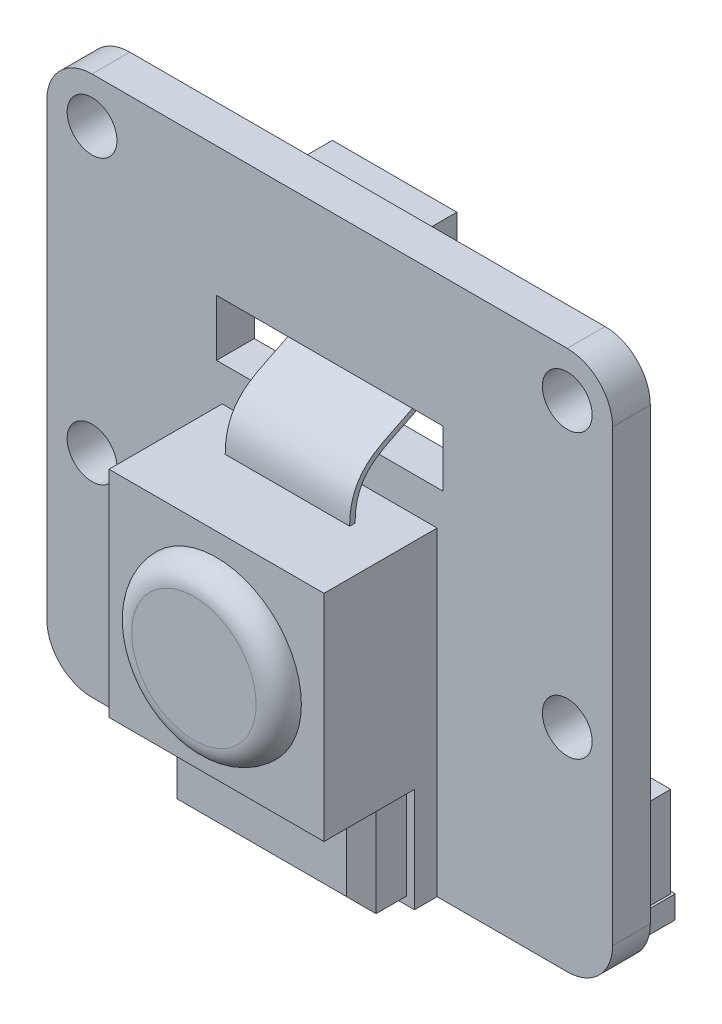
ISO-10303-21;
HEADER;
FILE_DESCRIPTION(('STEP AP214'),'2;1');
FILE_NAME('part.step','',(''),(''),'','','');
FILE_SCHEMA(('AUTOMOTIVE_DESIGN { 1 0 10303 214 1 1 1 1 }'));
ENDSEC;
DATA;
#1=APPLICATION_CONTEXT('core data for automotive mechanical design processes');
#2=APPLICATION_PROTOCOL_DEFINITION('international standard','automotive_design',2000,#1);
#3=PRODUCT_CONTEXT('',#1,'mechanical');
#4=PRODUCT('Part','Part','',(#3));
#5=PRODUCT_RELATED_PRODUCT_CATEGORY('part','',(#4));
#6=PRODUCT_DEFINITION_FORMATION('','',#4);
#7=PRODUCT_DEFINITION_CONTEXT('part definition',#1,'design');
#8=PRODUCT_DEFINITION('design','',#6,#7);
#9=PRODUCT_DEFINITION_SHAPE('','',#8);
#10=(LENGTH_UNIT() NAMED_UNIT(*) SI_UNIT(.MILLI.,.METRE.));
#11=(NAMED_UNIT(*) PLANE_ANGLE_UNIT() SI_UNIT($,.RADIAN.));
#12=(NAMED_UNIT(*) SI_UNIT($,.STERADIAN.) SOLID_ANGLE_UNIT());
#13=UNCERTAINTY_MEASURE_WITH_UNIT(LENGTH_MEASURE(1.E-05),#10,'distance_accuracy_value','');
#14=(GEOMETRIC_REPRESENTATION_CONTEXT(3) GLOBAL_UNCERTAINTY_ASSIGNED_CONTEXT((#13)) GLOBAL_UNIT_ASSIGNED_CONTEXT((#10,
#11,#12)) REPRESENTATION_CONTEXT('',''));
#15=CARTESIAN_POINT('',(0.,0.,0.));
#16=DIRECTION('',(0.,0.,1.));
#17=DIRECTION('',(1.,0.,0.));
#18=AXIS2_PLACEMENT_3D('',#15,#16,#17);
#19=CARTESIAN_POINT('',(-10.5,-9.93,0.));
#20=DIRECTION('',(0.,0.,-1.));
#21=DIRECTION('',(-1.,0.,0.));
#22=AXIS2_PLACEMENT_3D('',#19,#20,#21);
#23=PLANE('',#22);
#24=CARTESIAN_POINT('',(-10.5,-2.57,0.));
#25=DIRECTION('',(0.,0.,1.));
#26=DIRECTION('',(1.,0.,0.));
#27=AXIS2_PLACEMENT_3D('',#24,#25,#26);
#28=CIRCLE('',#27,1.1);
#29=CARTESIAN_POINT('',(-9.4,-2.57,0.));
#30=VERTEX_POINT('',#29);
#31=EDGE_CURVE('E699',#30,#30,#28,.T.);
#32=ORIENTED_EDGE('',*,*,#31,.T.);
#33=EDGE_LOOP('',(#32));
#34=FACE_BOUND('',#33,.T.);
#35=CARTESIAN_POINT('',(-10.5,9.93,0.));
#36=DIRECTION('',(0.,0.,1.));
#37=DIRECTION('',(1.,0.,0.));
#38=AXIS2_PLACEMENT_3D('',#35,#36,#37);
#39=CIRCLE('',#38,1.1);
#40=CARTESIAN_POINT('',(-9.4,9.93,0.));
#41=VERTEX_POINT('',#40);
#42=EDGE_CURVE('E687',#41,#41,#39,.T.);
#43=ORIENTED_EDGE('',*,*,#42,.T.);
#44=EDGE_LOOP('',(#43));
#45=FACE_BOUND('',#44,.T.);
#46=CARTESIAN_POINT('',(-10.5,-9.93,0.));
#47=DIRECTION('',(0.,0.,1.));
#48=DIRECTION('',(-1.,0.,0.));
#49=AXIS2_PLACEMENT_3D('',#46,#47,#48);
#50=CIRCLE('',#49,2.);
#51=CARTESIAN_POINT('',(-12.5,-9.92999999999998,0.));
#52=VERTEX_POINT('',#51);
#53=CARTESIAN_POINT('',(-10.5,-11.93,0.));
#54=VERTEX_POINT('',#53);
#55=EDGE_CURVE('E666',#52,#54,#50,.T.);
#56=ORIENTED_EDGE('',*,*,#55,.F.);
#57=DIRECTION('',(0.,-1.,0.));
#58=VECTOR('',#57,1.);
#59=CARTESIAN_POINT('',(-12.5,-9.92999999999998,0.));
#60=LINE('',#59,#58);
#61=CARTESIAN_POINT('',(-12.5,9.92999999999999,0.));
#62=VERTEX_POINT('',#61);
#63=EDGE_CURVE('E651',#62,#52,#60,.T.);
#64=ORIENTED_EDGE('',*,*,#63,.F.);
#65=CARTESIAN_POINT('',(-10.5,9.93,0.));
#66=DIRECTION('',(0.,0.,1.));
#67=DIRECTION('',(-1.,0.,0.));
#68=AXIS2_PLACEMENT_3D('',#65,#66,#67);
#69=CIRCLE('',#68,2.);
#70=CARTESIAN_POINT('',(-10.5,11.93,0.));
#71=VERTEX_POINT('',#70);
#72=EDGE_CURVE('E654',#71,#62,#69,.T.);
#73=ORIENTED_EDGE('',*,*,#72,.F.);
#74=DIRECTION('',(-1.,0.,0.));
#75=VECTOR('',#74,1.);
#76=CARTESIAN_POINT('',(-10.5,11.93,0.));
#77=LINE('',#76,#75);
#78=CARTESIAN_POINT('',(10.5,11.93,0.));
#79=VERTEX_POINT('',#78);
#80=EDGE_CURVE('E656',#79,#71,#77,.T.);
#81=ORIENTED_EDGE('',*,*,#80,.F.);
#82=CARTESIAN_POINT('',(10.5,9.93,0.));
#83=DIRECTION('',(0.,0.,1.));
#84=DIRECTION('',(-1.,0.,0.));
#85=AXIS2_PLACEMENT_3D('',#82,#83,#84);
#86=CIRCLE('',#85,2.);
#87=CARTESIAN_POINT('',(12.5,9.92999999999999,0.));
#88=VERTEX_POINT('',#87);
#89=EDGE_CURVE('E658',#88,#79,#86,.T.);
#90=ORIENTED_EDGE('',*,*,#89,.F.);
#91=DIRECTION('',(0.,1.,0.));
#92=VECTOR('',#91,1.);
#93=CARTESIAN_POINT('',(12.5,-9.92999999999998,0.));
#94=LINE('',#93,#92);
#95=CARTESIAN_POINT('',(12.5,-9.93,0.));
#96=VERTEX_POINT('',#95);
#97=EDGE_CURVE('E660',#96,#88,#94,.T.);
#98=ORIENTED_EDGE('',*,*,#97,.F.);
#99=CARTESIAN_POINT('',(10.5,-9.93,0.));
#100=DIRECTION('',(0.,0.,1.));
#101=DIRECTION('',(1.,0.,0.));
#102=AXIS2_PLACEMENT_3D('',#99,#100,#101);
#103=CIRCLE('',#102,2.);
#104=CARTESIAN_POINT('',(10.5,-11.93,0.));
#105=VERTEX_POINT('',#104);
#106=EDGE_CURVE('E662',#105,#96,#103,.T.);
#107=ORIENTED_EDGE('',*,*,#106,.F.);
#108=DIRECTION('',(1.,0.,0.));
#109=VECTOR('',#108,1.);
#110=CARTESIAN_POINT('',(-10.5,-11.93,0.));
#111=LINE('',#110,#109);
#112=EDGE_CURVE('E664',#54,#105,#111,.T.);
#113=ORIENTED_EDGE('',*,*,#112,.F.);
#114=EDGE_LOOP('',(#56,#64,#73,#81,#90,#98,#107,#113));
#115=FACE_BOUND('',#114,.T.);
#116=CARTESIAN_POINT('',(10.5,9.93,0.));
#117=DIRECTION('',(0.,0.,1.));
#118=DIRECTION('',(1.,0.,0.));
#119=AXIS2_PLACEMENT_3D('',#116,#117,#118);
#120=CIRCLE('',#119,1.1);
#121=CARTESIAN_POINT('',(11.6,9.93,0.));
#122=VERTEX_POINT('',#121);
#123=EDGE_CURVE('E693',#122,#122,#120,.T.);
#124=ORIENTED_EDGE('',*,*,#123,.T.);
#125=EDGE_LOOP('',(#124));
#126=FACE_BOUND('',#125,.T.);
#127=CARTESIAN_POINT('',(10.5,-2.57,0.));
#128=DIRECTION('',(0.,0.,1.));
#129=DIRECTION('',(1.,0.,0.));
#130=AXIS2_PLACEMENT_3D('',#127,#128,#129);
#131=CIRCLE('',#130,1.1);
#132=CARTESIAN_POINT('',(11.6,-2.57,0.));
#133=VERTEX_POINT('',#132);
#134=EDGE_CURVE('E705',#133,#133,#131,.T.);
#135=ORIENTED_EDGE('',*,*,#134,.T.);
#136=EDGE_LOOP('',(#135));
#137=FACE_BOUND('',#136,.T.);
#138=DIRECTION('',(1.,0.,0.));
#139=VECTOR('',#138,1.);
#140=CARTESIAN_POINT('',(-5.,3.72,0.));
#141=LINE('',#140,#139);
#142=CARTESIAN_POINT('',(-5.,3.72,0.));
#143=VERTEX_POINT('',#142);
#144=CARTESIAN_POINT('',(5.,3.72,0.));
#145=VERTEX_POINT('',#144);
#146=EDGE_CURVE('E721',#143,#145,#141,.T.);
#147=ORIENTED_EDGE('',*,*,#146,.T.);
#148=DIRECTION('',(0.,1.,0.));
#149=VECTOR('',#148,1.);
#150=CARTESIAN_POINT('',(5.,3.72,0.));
#151=LINE('',#150,#149);
#152=CARTESIAN_POINT('',(5.,6.21,0.));
#153=VERTEX_POINT('',#152);
#154=EDGE_CURVE('E731',#145,#153,#151,.T.);
#155=ORIENTED_EDGE('',*,*,#154,.T.);
#156=DIRECTION('',(-1.,0.,0.));
#157=VECTOR('',#156,1.);
#158=CARTESIAN_POINT('',(-5.,6.21,0.));
#159=LINE('',#158,#157);
#160=CARTESIAN_POINT('',(-5.,6.21,0.));
#161=VERTEX_POINT('',#160);
#162=EDGE_CURVE('E728',#153,#161,#159,.T.);
#163=ORIENTED_EDGE('',*,*,#162,.T.);
#164=DIRECTION('',(0.,-1.,0.));
#165=VECTOR('',#164,1.);
#166=CARTESIAN_POINT('',(-5.,3.72,0.));
#167=LINE('',#166,#165);
#168=EDGE_CURVE('E725',#161,#143,#167,.T.);
#169=ORIENTED_EDGE('',*,*,#168,.T.);
#170=EDGE_LOOP('',(#147,#155,#163,#169));
#171=FACE_BOUND('',#170,.T.);
#172=DIRECTION('',(-1.,0.,0.));
#173=VECTOR('',#172,1.);
#174=CARTESIAN_POINT('',(15.4990073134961,7.33,0.));
#175=LINE('',#174,#173);
#176=CARTESIAN_POINT('',(2.75000000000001,7.33,0.));
#177=VERTEX_POINT('',#176);
#178=CARTESIAN_POINT('',(-2.75,7.33,0.));
#179=VERTEX_POINT('',#178);
#180=EDGE_CURVE('E819',#177,#179,#175,.T.);
#181=ORIENTED_EDGE('',*,*,#180,.F.);
#182=DIRECTION('',(0.,1.,0.));
#183=VECTOR('',#182,1.);
#184=CARTESIAN_POINT('',(2.75,7.33,0.));
#185=LINE('',#184,#183);
#186=CARTESIAN_POINT('',(2.75,11.83,0.));
#187=VERTEX_POINT('',#186);
#188=EDGE_CURVE('E396',#177,#187,#185,.T.);
#189=ORIENTED_EDGE('',*,*,#188,.T.);
#190=DIRECTION('',(-1.,0.,0.));
#191=VECTOR('',#190,1.);
#192=CARTESIAN_POINT('',(15.4990073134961,11.83,0.));
#193=LINE('',#192,#191);
#194=CARTESIAN_POINT('',(-2.75,11.83,0.));
#195=VERTEX_POINT('',#194);
#196=EDGE_CURVE('E816',#187,#195,#193,.T.);
#197=ORIENTED_EDGE('',*,*,#196,.T.);
#198=DIRECTION('',(0.,1.,0.));
#199=VECTOR('',#198,1.);
#200=CARTESIAN_POINT('',(-2.75,7.33,0.));
#201=LINE('',#200,#199);
#202=EDGE_CURVE('E380',#179,#195,#201,.T.);
#203=ORIENTED_EDGE('',*,*,#202,.F.);
#204=EDGE_LOOP('',(#181,#189,#197,#203));
#205=FACE_BOUND('',#204,.T.);
#206=DIRECTION('',(1.,0.,0.));
#207=VECTOR('',#206,1.);
#208=CARTESIAN_POINT('',(11.,-10.83,0.));
#209=LINE('',#208,#207);
#210=CARTESIAN_POINT('',(10.9,-10.83,0.));
#211=VERTEX_POINT('',#210);
#212=CARTESIAN_POINT('',(11.,-10.83,0.));
#213=VERTEX_POINT('',#212);
#214=EDGE_CURVE('E324',#211,#213,#209,.T.);
#215=ORIENTED_EDGE('',*,*,#214,.F.);
#216=DIRECTION('',(0.,-1.,0.));
#217=VECTOR('',#216,1.);
#218=CARTESIAN_POINT('',(10.9,-10.83,0.));
#219=LINE('',#218,#217);
#220=CARTESIAN_POINT('',(10.9,-6.83,0.));
#221=VERTEX_POINT('',#220);
#222=EDGE_CURVE('E328',#221,#211,#219,.T.);
#223=ORIENTED_EDGE('',*,*,#222,.F.);
#224=DIRECTION('',(1.,0.,0.));
#225=VECTOR('',#224,1.);
#226=CARTESIAN_POINT('',(10.9,-6.83,0.));
#227=LINE('',#226,#225);
#228=CARTESIAN_POINT('',(-10.9,-6.83,0.));
#229=VERTEX_POINT('',#228);
#230=EDGE_CURVE('E311',#229,#221,#227,.T.);
#231=ORIENTED_EDGE('',*,*,#230,.F.);
#232=DIRECTION('',(0.,1.,0.));
#233=VECTOR('',#232,1.);
#234=CARTESIAN_POINT('',(-10.9,-10.83,0.));
#235=LINE('',#234,#233);
#236=CARTESIAN_POINT('',(-10.9,-10.83,0.));
#237=VERTEX_POINT('',#236);
#238=EDGE_CURVE('E307',#237,#229,#235,.T.);
#239=ORIENTED_EDGE('',*,*,#238,.F.);
#240=CARTESIAN_POINT('',(-11.,-10.83,0.));
#241=VERTEX_POINT('',#240);
#242=EDGE_CURVE('E349',#241,#237,#209,.T.);
#243=ORIENTED_EDGE('',*,*,#242,.F.);
#244=DIRECTION('',(0.,1.,0.));
#245=VECTOR('',#244,1.);
#246=CARTESIAN_POINT('',(-11.,-10.83,0.));
#247=LINE('',#246,#245);
#248=CARTESIAN_POINT('',(-11.,-11.83,0.));
#249=VERTEX_POINT('',#248);
#250=EDGE_CURVE('E321',#249,#241,#247,.T.);
#251=ORIENTED_EDGE('',*,*,#250,.F.);
#252=DIRECTION('',(-1.,0.,0.));
#253=VECTOR('',#252,1.);
#254=CARTESIAN_POINT('',(11.,-11.83,0.));
#255=LINE('',#254,#253);
#256=CARTESIAN_POINT('',(11.,-11.83,0.));
#257=VERTEX_POINT('',#256);
#258=EDGE_CURVE('E342',#257,#249,#255,.T.);
#259=ORIENTED_EDGE('',*,*,#258,.F.);
#260=DIRECTION('',(0.,-1.,0.));
#261=VECTOR('',#260,1.);
#262=CARTESIAN_POINT('',(11.,-10.83,0.));
#263=LINE('',#262,#261);
#264=EDGE_CURVE('E352',#213,#257,#263,.T.);
#265=ORIENTED_EDGE('',*,*,#264,.F.);
#266=EDGE_LOOP('',(#215,#223,#231,#239,#243,#251,#259,#265));
#267=FACE_BOUND('',#266,.T.);
#268=ADVANCED_FACE('F41',(#34,#45,#115,#126,#137,#171,#205,#267),#23,.T.);
#269=CARTESIAN_POINT('',(11.,-10.83,-2.6));
#270=DIRECTION('',(0.,-1.,0.));
#271=DIRECTION('',(0.,0.,-1.));
#272=AXIS2_PLACEMENT_3D('',#269,#270,#271);
#273=PLANE('',#272);
#274=DIRECTION('',(0.,0.,1.));
#275=VECTOR('',#274,1.);
#276=CARTESIAN_POINT('',(10.9,-10.83,-24.7639346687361));
#277=LINE('',#276,#275);
#278=CARTESIAN_POINT('',(10.9,-10.83,-2.5));
#279=VERTEX_POINT('',#278);
#280=EDGE_CURVE('E332',#279,#211,#277,.T.);
#281=ORIENTED_EDGE('',*,*,#280,.T.);
#282=ORIENTED_EDGE('',*,*,#214,.T.);
#283=DIRECTION('',(0.,0.,1.));
#284=VECTOR('',#283,1.);
#285=CARTESIAN_POINT('',(11.,-10.83,-2.6));
#286=LINE('',#285,#284);
#287=CARTESIAN_POINT('',(11.,-10.83,-2.6));
#288=VERTEX_POINT('',#287);
#289=EDGE_CURVE('E358',#288,#213,#286,.T.);
#290=ORIENTED_EDGE('',*,*,#289,.F.);
#291=DIRECTION('',(1.,0.,0.));
#292=VECTOR('',#291,1.);
#293=CARTESIAN_POINT('',(11.,-10.83,-2.6));
#294=LINE('',#293,#292);
#295=CARTESIAN_POINT('',(-11.,-10.83,-2.6));
#296=VERTEX_POINT('',#295);
#297=EDGE_CURVE('E341',#296,#288,#294,.T.);
#298=ORIENTED_EDGE('',*,*,#297,.F.);
#299=DIRECTION('',(0.,0.,1.));
#300=VECTOR('',#299,1.);
#301=CARTESIAN_POINT('',(-11.,-10.83,-2.6));
#302=LINE('',#301,#300);
#303=EDGE_CURVE('E361',#296,#241,#302,.T.);
#304=ORIENTED_EDGE('',*,*,#303,.T.);
#305=ORIENTED_EDGE('',*,*,#242,.T.);
#306=DIRECTION('',(0.,0.,1.));
#307=VECTOR('',#306,1.);
#308=CARTESIAN_POINT('',(-10.9,-10.83,-24.7639346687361));
#309=LINE('',#308,#307);
#310=CARTESIAN_POINT('',(-10.9,-10.83,-2.50000000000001));
#311=VERTEX_POINT('',#310);
#312=EDGE_CURVE('E335',#311,#237,#309,.T.);
#313=ORIENTED_EDGE('',*,*,#312,.F.);
#314=DIRECTION('',(-1.,0.,0.));
#315=VECTOR('',#314,1.);
#316=CARTESIAN_POINT('',(10.9,-10.83,-2.5));
#317=LINE('',#316,#315);
#318=EDGE_CURVE('E319',#279,#311,#317,.T.);
#319=ORIENTED_EDGE('',*,*,#318,.F.);
#320=EDGE_LOOP('',(#281,#282,#290,#298,#304,#305,#313,#319));
#321=FACE_BOUND('',#320,.T.);
#322=ADVANCED_FACE('F494',(#321),#273,.F.);
#323=CARTESIAN_POINT('',(-4.75,2.18,6.67));
#324=DIRECTION('',(0.,-1.,0.));
#325=DIRECTION('',(0.,0.,-1.));
#326=AXIS2_PLACEMENT_3D('',#323,#324,#325);
#327=PLANE('',#326);
#328=DIRECTION('',(-1.,0.,0.));
#329=VECTOR('',#328,1.);
#330=CARTESIAN_POINT('',(-4.75,2.18,1.67));
#331=LINE('',#330,#329);
#332=CARTESIAN_POINT('',(4.75,2.18,1.67));
#333=VERTEX_POINT('',#332);
#334=CARTESIAN_POINT('',(-4.75,2.18,1.67));
#335=VERTEX_POINT('',#334);
#336=EDGE_CURVE('E757',#333,#335,#331,.T.);
#337=ORIENTED_EDGE('',*,*,#336,.T.);
#338=DIRECTION('',(0.,0.,-1.));
#339=VECTOR('',#338,1.);
#340=CARTESIAN_POINT('',(-4.75,2.18,6.67));
#341=LINE('',#340,#339);
#342=CARTESIAN_POINT('',(-4.75,2.18,6.67));
#343=VERTEX_POINT('',#342);
#344=EDGE_CURVE('E744',#343,#335,#341,.T.);
#345=ORIENTED_EDGE('',*,*,#344,.F.);
#346=DIRECTION('',(-1.,0.,0.));
#347=VECTOR('',#346,1.);
#348=CARTESIAN_POINT('',(-4.75,2.18,6.67));
#349=LINE('',#348,#347);
#350=CARTESIAN_POINT('',(4.75,2.18,6.67));
#351=VERTEX_POINT('',#350);
#352=EDGE_CURVE('E767',#351,#343,#349,.T.);
#353=ORIENTED_EDGE('',*,*,#352,.F.);
#354=DIRECTION('',(0.,0.,-1.));
#355=VECTOR('',#354,1.);
#356=CARTESIAN_POINT('',(4.75,2.18,6.67));
#357=LINE('',#356,#355);
#358=EDGE_CURVE('E734',#351,#333,#357,.T.);
#359=ORIENTED_EDGE('',*,*,#358,.T.);
#360=EDGE_LOOP('',(#337,#345,#353,#359));
#361=FACE_BOUND('',#360,.T.);
#362=DIRECTION('',(0.,0.,1.));
#363=VECTOR('',#362,1.);
#364=CARTESIAN_POINT('',(2.75,2.18,3.29831223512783));
#365=LINE('',#364,#363);
#366=CARTESIAN_POINT('',(2.75000000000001,2.18,3.29831223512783));
#367=VERTEX_POINT('',#366);
#368=CARTESIAN_POINT('',(2.75000000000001,2.18,3.53483455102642));
#369=VERTEX_POINT('',#368);
#370=EDGE_CURVE('E414',#367,#369,#365,.T.);
#371=ORIENTED_EDGE('',*,*,#370,.T.);
#372=DIRECTION('',(-1.,0.,0.));
#373=VECTOR('',#372,1.);
#374=CARTESIAN_POINT('',(15.4990073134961,2.18,3.53483455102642));
#375=LINE('',#374,#373);
#376=CARTESIAN_POINT('',(-2.75,2.18,3.53483455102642));
#377=VERTEX_POINT('',#376);
#378=EDGE_CURVE('E805',#369,#377,#375,.T.);
#379=ORIENTED_EDGE('',*,*,#378,.T.);
#380=DIRECTION('',(0.,0.,1.));
#381=VECTOR('',#380,1.);
#382=CARTESIAN_POINT('',(-2.75,2.18,3.29831223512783));
#383=LINE('',#382,#381);
#384=CARTESIAN_POINT('',(-2.75,2.18,3.29831223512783));
#385=VERTEX_POINT('',#384);
#386=EDGE_CURVE('E389',#385,#377,#383,.T.);
#387=ORIENTED_EDGE('',*,*,#386,.F.);
#388=DIRECTION('',(-1.,0.,0.));
#389=VECTOR('',#388,1.);
#390=CARTESIAN_POINT('',(15.4990073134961,2.18,3.29831223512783));
#391=LINE('',#390,#389);
#392=EDGE_CURVE('E807',#367,#385,#391,.T.);
#393=ORIENTED_EDGE('',*,*,#392,.F.);
#394=EDGE_LOOP('',(#371,#379,#387,#393));
#395=FACE_BOUND('',#394,.T.);
#396=ADVANCED_FACE('F473',(#361,#395),#327,.F.);
#397=CARTESIAN_POINT('',(0.,0.,2.67));
#398=DIRECTION('',(0.,0.,1.));
#399=DIRECTION('',(1.,0.,0.));
#400=AXIS2_PLACEMENT_3D('',#397,#398,#399);
#401=PLANE('',#400);
#402=DIRECTION('',(0.,-1.,0.));
#403=VECTOR('',#402,1.);
#404=CARTESIAN_POINT('',(-4.75,-7.32,2.67));
#405=LINE('',#404,#403);
#406=CARTESIAN_POINT('',(-4.75,-7.32,2.67));
#407=VERTEX_POINT('',#406);
#408=CARTESIAN_POINT('',(-4.75,-11.93,2.67));
#409=VERTEX_POINT('',#408);
#410=EDGE_CURVE('E784',#407,#409,#405,.T.);
#411=ORIENTED_EDGE('',*,*,#410,.T.);
#412=DIRECTION('',(1.,0.,0.));
#413=VECTOR('',#412,1.);
#414=CARTESIAN_POINT('',(-4.75,-11.93,2.67));
#415=LINE('',#414,#413);
#416=CARTESIAN_POINT('',(4.75,-11.93,2.67));
#417=VERTEX_POINT('',#416);
#418=EDGE_CURVE('E782',#409,#417,#415,.T.);
#419=ORIENTED_EDGE('',*,*,#418,.T.);
#420=DIRECTION('',(0.,1.,0.));
#421=VECTOR('',#420,1.);
#422=CARTESIAN_POINT('',(4.75,-7.32,2.67));
#423=LINE('',#422,#421);
#424=CARTESIAN_POINT('',(4.75,-7.32,2.67));
#425=VERTEX_POINT('',#424);
#426=EDGE_CURVE('E780',#417,#425,#423,.T.);
#427=ORIENTED_EDGE('',*,*,#426,.T.);
#428=DIRECTION('',(-1.,0.,0.));
#429=VECTOR('',#428,1.);
#430=CARTESIAN_POINT('',(-4.75,-7.32,2.67));
#431=LINE('',#430,#429);
#432=EDGE_CURVE('E778',#425,#407,#431,.T.);
#433=ORIENTED_EDGE('',*,*,#432,.T.);
#434=EDGE_LOOP('',(#411,#419,#427,#433));
#435=FACE_BOUND('',#434,.T.);
#436=DIRECTION('',(-1.,0.,0.));
#437=VECTOR('',#436,1.);
#438=CARTESIAN_POINT('',(-4.4,-7.67,2.67));
#439=LINE('',#438,#437);
#440=CARTESIAN_POINT('',(4.4,-7.67,2.67));
#441=VERTEX_POINT('',#440);
#442=CARTESIAN_POINT('',(-4.4,-7.67,2.67));
#443=VERTEX_POINT('',#442);
#444=EDGE_CURVE('E600',#441,#443,#439,.T.);
#445=ORIENTED_EDGE('',*,*,#444,.F.);
#446=DIRECTION('',(0.,1.,0.));
#447=VECTOR('',#446,1.);
#448=CARTESIAN_POINT('',(4.4,-11.58,2.67));
#449=LINE('',#448,#447);
#450=CARTESIAN_POINT('',(4.4,-11.58,2.67));
#451=VERTEX_POINT('',#450);
#452=EDGE_CURVE('E597',#451,#441,#449,.T.);
#453=ORIENTED_EDGE('',*,*,#452,.F.);
#454=DIRECTION('',(1.,0.,0.));
#455=VECTOR('',#454,1.);
#456=CARTESIAN_POINT('',(-4.4,-11.58,2.67));
#457=LINE('',#456,#455);
#458=CARTESIAN_POINT('',(-4.4,-11.58,2.67));
#459=VERTEX_POINT('',#458);
#460=EDGE_CURVE('E795',#459,#451,#457,.T.);
#461=ORIENTED_EDGE('',*,*,#460,.F.);
#462=DIRECTION('',(0.,-1.,0.));
#463=VECTOR('',#462,1.);
#464=CARTESIAN_POINT('',(-4.4,-11.58,2.67));
#465=LINE('',#464,#463);
#466=EDGE_CURVE('E798',#443,#459,#465,.T.);
#467=ORIENTED_EDGE('',*,*,#466,.F.);
#468=EDGE_LOOP('',(#445,#453,#461,#467));
#469=FACE_BOUND('',#468,.T.);
#470=ADVANCED_FACE('F469',(#435,#469),#401,.T.);
#471=CARTESIAN_POINT('',(-10.5,-9.93,1.67));
#472=DIRECTION('',(0.,0.,-1.));
#473=DIRECTION('',(-1.,0.,0.));
#474=AXIS2_PLACEMENT_3D('',#471,#472,#473);
#475=PLANE('',#474);
#476=CARTESIAN_POINT('',(10.5,-2.57,1.67));
#477=DIRECTION('',(0.,0.,1.));
#478=DIRECTION('',(1.,0.,0.));
#479=AXIS2_PLACEMENT_3D('',#476,#477,#478);
#480=CIRCLE('',#479,1.1);
#481=CARTESIAN_POINT('',(11.6,-2.57,1.67));
#482=VERTEX_POINT('',#481);
#483=EDGE_CURVE('E702',#482,#482,#480,.T.);
#484=ORIENTED_EDGE('',*,*,#483,.F.);
#485=EDGE_LOOP('',(#484));
#486=FACE_BOUND('',#485,.T.);
#487=CARTESIAN_POINT('',(-10.5,-2.57,1.67));
#488=DIRECTION('',(0.,0.,1.));
#489=DIRECTION('',(1.,0.,0.));
#490=AXIS2_PLACEMENT_3D('',#487,#488,#489);
#491=CIRCLE('',#490,1.1);
#492=CARTESIAN_POINT('',(-9.4,-2.57,1.67));
#493=VERTEX_POINT('',#492);
#494=EDGE_CURVE('E696',#493,#493,#491,.T.);
#495=ORIENTED_EDGE('',*,*,#494,.F.);
#496=EDGE_LOOP('',(#495));
#497=FACE_BOUND('',#496,.T.);
#498=CARTESIAN_POINT('',(10.5,9.93,1.67));
#499=DIRECTION('',(0.,0.,1.));
#500=DIRECTION('',(1.,0.,0.));
#501=AXIS2_PLACEMENT_3D('',#498,#499,#500);
#502=CIRCLE('',#501,1.1);
#503=CARTESIAN_POINT('',(11.6,9.93,1.67));
#504=VERTEX_POINT('',#503);
#505=EDGE_CURVE('E690',#504,#504,#502,.T.);
#506=ORIENTED_EDGE('',*,*,#505,.F.);
#507=EDGE_LOOP('',(#506));
#508=FACE_BOUND('',#507,.T.);
#509=CARTESIAN_POINT('',(-10.5,9.93,1.67));
#510=DIRECTION('',(0.,0.,1.));
#511=DIRECTION('',(1.,0.,0.));
#512=AXIS2_PLACEMENT_3D('',#509,#510,#511);
#513=CIRCLE('',#512,1.1);
#514=CARTESIAN_POINT('',(-9.4,9.93,1.67));
#515=VERTEX_POINT('',#514);
#516=EDGE_CURVE('E669',#515,#515,#513,.T.);
#517=ORIENTED_EDGE('',*,*,#516,.F.);
#518=EDGE_LOOP('',(#517));
#519=FACE_BOUND('',#518,.T.);
#520=DIRECTION('',(0.,1.,0.));
#521=VECTOR('',#520,1.);
#522=CARTESIAN_POINT('',(5.,3.72,1.67));
#523=LINE('',#522,#521);
#524=CARTESIAN_POINT('',(5.,3.72,1.67));
#525=VERTEX_POINT('',#524);
#526=CARTESIAN_POINT('',(5.,6.21,1.67));
#527=VERTEX_POINT('',#526);
#528=EDGE_CURVE('E724',#525,#527,#523,.T.);
#529=ORIENTED_EDGE('',*,*,#528,.F.);
#530=DIRECTION('',(1.,0.,0.));
#531=VECTOR('',#530,1.);
#532=CARTESIAN_POINT('',(-5.,3.72,1.67));
#533=LINE('',#532,#531);
#534=CARTESIAN_POINT('',(-5.,3.72,1.67));
#535=VERTEX_POINT('',#534);
#536=EDGE_CURVE('E720',#535,#525,#533,.T.);
#537=ORIENTED_EDGE('',*,*,#536,.F.);
#538=DIRECTION('',(0.,-1.,0.));
#539=VECTOR('',#538,1.);
#540=CARTESIAN_POINT('',(-5.,3.72,1.67));
#541=LINE('',#540,#539);
#542=CARTESIAN_POINT('',(-5.,6.21,1.67));
#543=VERTEX_POINT('',#542);
#544=EDGE_CURVE('E736',#543,#535,#541,.T.);
#545=ORIENTED_EDGE('',*,*,#544,.F.);
#546=DIRECTION('',(-1.,0.,0.));
#547=VECTOR('',#546,1.);
#548=CARTESIAN_POINT('',(-5.,6.21,1.67));
#549=LINE('',#548,#547);
#550=EDGE_CURVE('E739',#527,#543,#549,.T.);
#551=ORIENTED_EDGE('',*,*,#550,.F.);
#552=EDGE_LOOP('',(#529,#537,#545,#551));
#553=FACE_BOUND('',#552,.T.);
#554=DIRECTION('',(1.,0.,0.));
#555=VECTOR('',#554,1.);
#556=CARTESIAN_POINT('',(-10.5,-11.93,1.67));
#557=LINE('',#556,#555);
#558=CARTESIAN_POINT('',(-10.5,-11.93,1.67));
#559=VERTEX_POINT('',#558);
#560=CARTESIAN_POINT('',(-4.75,-11.93,1.67));
#561=VERTEX_POINT('',#560);
#562=EDGE_CURVE('E681',#559,#561,#557,.T.);
#563=ORIENTED_EDGE('',*,*,#562,.T.);
#564=DIRECTION('',(0.,-1.,0.));
#565=VECTOR('',#564,1.);
#566=CARTESIAN_POINT('',(-4.75,-7.32,1.67));
#567=LINE('',#566,#565);
#568=EDGE_CURVE('E754',#335,#561,#567,.T.);
#569=ORIENTED_EDGE('',*,*,#568,.F.);
#570=ORIENTED_EDGE('',*,*,#336,.F.);
#571=DIRECTION('',(0.,1.,0.));
#572=VECTOR('',#571,1.);
#573=CARTESIAN_POINT('',(4.75,-7.32,1.67));
#574=LINE('',#573,#572);
#575=CARTESIAN_POINT('',(4.75,-11.93,1.67));
#576=VERTEX_POINT('',#575);
#577=EDGE_CURVE('E760',#576,#333,#574,.T.);
#578=ORIENTED_EDGE('',*,*,#577,.F.);
#579=CARTESIAN_POINT('',(10.5,-11.93,1.67));
#580=VERTEX_POINT('',#579);
#581=EDGE_CURVE('E684',#576,#580,#557,.T.);
#582=ORIENTED_EDGE('',*,*,#581,.T.);
#583=CARTESIAN_POINT('',(10.5,-9.93,1.67));
#584=DIRECTION('',(0.,0.,1.));
#585=DIRECTION('',(1.,0.,0.));
#586=AXIS2_PLACEMENT_3D('',#583,#584,#585);
#587=CIRCLE('',#586,2.);
#588=CARTESIAN_POINT('',(12.5,-9.93,1.67));
#589=VERTEX_POINT('',#588);
#590=EDGE_CURVE('E679',#580,#589,#587,.T.);
#591=ORIENTED_EDGE('',*,*,#590,.T.);
#592=DIRECTION('',(0.,1.,0.));
#593=VECTOR('',#592,1.);
#594=CARTESIAN_POINT('',(12.5,-9.92999999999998,1.67));
#595=LINE('',#594,#593);
#596=CARTESIAN_POINT('',(12.5,9.92999999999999,1.67));
#597=VERTEX_POINT('',#596);
#598=EDGE_CURVE('E677',#589,#597,#595,.T.);
#599=ORIENTED_EDGE('',*,*,#598,.T.);
#600=CARTESIAN_POINT('',(10.5,9.93,1.67));
#601=DIRECTION('',(0.,0.,1.));
#602=DIRECTION('',(-1.,0.,0.));
#603=AXIS2_PLACEMENT_3D('',#600,#601,#602);
#604=CIRCLE('',#603,2.);
#605=CARTESIAN_POINT('',(10.5,11.93,1.67));
#606=VERTEX_POINT('',#605);
#607=EDGE_CURVE('E675',#597,#606,#604,.T.);
#608=ORIENTED_EDGE('',*,*,#607,.T.);
#609=DIRECTION('',(-1.,0.,0.));
#610=VECTOR('',#609,1.);
#611=CARTESIAN_POINT('',(-10.5,11.93,1.67));
#612=LINE('',#611,#610);
#613=CARTESIAN_POINT('',(-10.5,11.93,1.67));
#614=VERTEX_POINT('',#613);
#615=EDGE_CURVE('E673',#606,#614,#612,.T.);
#616=ORIENTED_EDGE('',*,*,#615,.T.);
#617=CARTESIAN_POINT('',(-10.5,9.93,1.67));
#618=DIRECTION('',(0.,0.,1.));
#619=DIRECTION('',(-1.,0.,0.));
#620=AXIS2_PLACEMENT_3D('',#617,#618,#619);
#621=CIRCLE('',#620,2.);
#622=CARTESIAN_POINT('',(-12.5,9.92999999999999,1.67));
#623=VERTEX_POINT('',#622);
#624=EDGE_CURVE('E671',#614,#623,#621,.T.);
#625=ORIENTED_EDGE('',*,*,#624,.T.);
#626=DIRECTION('',(0.,-1.,0.));
#627=VECTOR('',#626,1.);
#628=CARTESIAN_POINT('',(-12.5,-9.92999999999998,1.67));
#629=LINE('',#628,#627);
#630=CARTESIAN_POINT('',(-12.5,-9.92999999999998,1.67));
#631=VERTEX_POINT('',#630);
#632=EDGE_CURVE('E650',#623,#631,#629,.T.);
#633=ORIENTED_EDGE('',*,*,#632,.T.);
#634=CARTESIAN_POINT('',(-10.5,-9.93,1.67));
#635=DIRECTION('',(0.,0.,1.));
#636=DIRECTION('',(-1.,0.,0.));
#637=AXIS2_PLACEMENT_3D('',#634,#635,#636);
#638=CIRCLE('',#637,2.);
#639=EDGE_CURVE('E653',#631,#559,#638,.T.);
#640=ORIENTED_EDGE('',*,*,#639,.T.);
#641=EDGE_LOOP('',(#563,#569,#570,#578,#582,#591,#599,#608,#616,#625,#633,#640));
#642=FACE_BOUND('',#641,.T.);
#643=ADVANCED_FACE('F472',(#486,#497,#508,#519,#553,#642),#475,.F.);
#644=CARTESIAN_POINT('',(-10.5,-9.93,1.67));
#645=DIRECTION('',(0.,0.,-1.));
#646=DIRECTION('',(-1.,0.,0.));
#647=AXIS2_PLACEMENT_3D('',#644,#645,#646);
#648=CYLINDRICAL_SURFACE('',#647,2.);
#649=ORIENTED_EDGE('',*,*,#55,.T.);
#650=DIRECTION('',(0.,0.,-1.));
#651=VECTOR('',#650,1.);
#652=CARTESIAN_POINT('',(-10.5,-11.93,1.67));
#653=LINE('',#652,#651);
#654=EDGE_CURVE('E626',#559,#54,#653,.T.);
#655=ORIENTED_EDGE('',*,*,#654,.F.);
#656=ORIENTED_EDGE('',*,*,#639,.F.);
#657=DIRECTION('',(0.,0.,-1.));
#658=VECTOR('',#657,1.);
#659=CARTESIAN_POINT('',(-12.5,-9.92999999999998,1.67));
#660=LINE('',#659,#658);
#661=EDGE_CURVE('E647',#631,#52,#660,.T.);
#662=ORIENTED_EDGE('',*,*,#661,.T.);
#663=EDGE_LOOP('',(#649,#655,#656,#662));
#664=FACE_BOUND('',#663,.T.);
#665=ADVANCED_FACE('F534',(#664),#648,.T.);
#666=CARTESIAN_POINT('',(-10.5,-11.93,1.67));
#667=DIRECTION('',(0.,1.,0.));
#668=DIRECTION('',(0.,0.,1.));
#669=AXIS2_PLACEMENT_3D('',#666,#667,#668);
#670=PLANE('',#669);
#671=ORIENTED_EDGE('',*,*,#112,.T.);
#672=DIRECTION('',(0.,0.,-1.));
#673=VECTOR('',#672,1.);
#674=CARTESIAN_POINT('',(10.5,-11.93,1.67));
#675=LINE('',#674,#673);
#676=EDGE_CURVE('E629',#580,#105,#675,.T.);
#677=ORIENTED_EDGE('',*,*,#676,.F.);
#678=ORIENTED_EDGE('',*,*,#581,.F.);
#679=DIRECTION('',(0.,0.,-1.));
#680=VECTOR('',#679,1.);
#681=CARTESIAN_POINT('',(4.75,-11.93,2.67));
#682=LINE('',#681,#680);
#683=EDGE_CURVE('E775',#417,#576,#682,.T.);
#684=ORIENTED_EDGE('',*,*,#683,.F.);
#685=ORIENTED_EDGE('',*,*,#418,.F.);
#686=DIRECTION('',(0.,0.,-1.));
#687=VECTOR('',#686,1.);
#688=CARTESIAN_POINT('',(-4.75,-11.93,2.67));
#689=LINE('',#688,#687);
#690=EDGE_CURVE('E763',#409,#561,#689,.T.);
#691=ORIENTED_EDGE('',*,*,#690,.T.);
#692=ORIENTED_EDGE('',*,*,#562,.F.);
#693=ORIENTED_EDGE('',*,*,#654,.T.);
#694=EDGE_LOOP('',(#671,#677,#678,#684,#685,#691,#692,#693));
#695=FACE_BOUND('',#694,.T.);
#696=ADVANCED_FACE('F561',(#695),#670,.F.);
#697=CARTESIAN_POINT('',(10.5,-9.93,1.67));
#698=DIRECTION('',(0.,0.,-1.));
#699=DIRECTION('',(-1.,0.,0.));
#700=AXIS2_PLACEMENT_3D('',#697,#698,#699);
#701=CYLINDRICAL_SURFACE('',#700,2.);
#702=ORIENTED_EDGE('',*,*,#106,.T.);
#703=DIRECTION('',(0.,0.,-1.));
#704=VECTOR('',#703,1.);
#705=CARTESIAN_POINT('',(12.5,-9.93,1.67));
#706=LINE('',#705,#704);
#707=EDGE_CURVE('E632',#589,#96,#706,.T.);
#708=ORIENTED_EDGE('',*,*,#707,.F.);
#709=ORIENTED_EDGE('',*,*,#590,.F.);
#710=ORIENTED_EDGE('',*,*,#676,.T.);
#711=EDGE_LOOP('',(#702,#708,#709,#710));
#712=FACE_BOUND('',#711,.T.);
#713=ADVANCED_FACE('F557',(#712),#701,.T.);
#714=CARTESIAN_POINT('',(12.5,-9.92999999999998,1.67));
#715=DIRECTION('',(-1.,0.,0.));
#716=DIRECTION('',(0.,0.,1.));
#717=AXIS2_PLACEMENT_3D('',#714,#715,#716);
#718=PLANE('',#717);
#719=ORIENTED_EDGE('',*,*,#97,.T.);
#720=DIRECTION('',(0.,0.,-1.));
#721=VECTOR('',#720,1.);
#722=CARTESIAN_POINT('',(12.5,9.92999999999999,1.67));
#723=LINE('',#722,#721);
#724=EDGE_CURVE('E635',#597,#88,#723,.T.);
#725=ORIENTED_EDGE('',*,*,#724,.F.);
#726=ORIENTED_EDGE('',*,*,#598,.F.);
#727=ORIENTED_EDGE('',*,*,#707,.T.);
#728=EDGE_LOOP('',(#719,#725,#726,#727));
#729=FACE_BOUND('',#728,.T.);
#730=ADVANCED_FACE('F553',(#729),#718,.F.);
#731=CARTESIAN_POINT('',(10.5,9.93,1.67));
#732=DIRECTION('',(0.,0.,-1.));
#733=DIRECTION('',(-1.,0.,0.));
#734=AXIS2_PLACEMENT_3D('',#731,#732,#733);
#735=CYLINDRICAL_SURFACE('',#734,2.);
#736=ORIENTED_EDGE('',*,*,#89,.T.);
#737=DIRECTION('',(0.,0.,-1.));
#738=VECTOR('',#737,1.);
#739=CARTESIAN_POINT('',(10.5,11.93,1.67));
#740=LINE('',#739,#738);
#741=EDGE_CURVE('E638',#606,#79,#740,.T.);
#742=ORIENTED_EDGE('',*,*,#741,.F.);
#743=ORIENTED_EDGE('',*,*,#607,.F.);
#744=ORIENTED_EDGE('',*,*,#724,.T.);
#745=EDGE_LOOP('',(#736,#742,#743,#744));
#746=FACE_BOUND('',#745,.T.);
#747=ADVANCED_FACE('F549',(#746),#735,.T.);
#748=CARTESIAN_POINT('',(-10.5,11.93,1.67));
#749=DIRECTION('',(0.,-1.,0.));
#750=DIRECTION('',(0.,0.,-1.));
#751=AXIS2_PLACEMENT_3D('',#748,#749,#750);
#752=PLANE('',#751);
#753=ORIENTED_EDGE('',*,*,#80,.T.);
#754=DIRECTION('',(0.,0.,-1.));
#755=VECTOR('',#754,1.);
#756=CARTESIAN_POINT('',(-10.5,11.93,1.67));
#757=LINE('',#756,#755);
#758=EDGE_CURVE('E641',#614,#71,#757,.T.);
#759=ORIENTED_EDGE('',*,*,#758,.F.);
#760=ORIENTED_EDGE('',*,*,#615,.F.);
#761=ORIENTED_EDGE('',*,*,#741,.T.);
#762=EDGE_LOOP('',(#753,#759,#760,#761));
#763=FACE_BOUND('',#762,.T.);
#764=ADVANCED_FACE('F545',(#763),#752,.F.);
#765=CARTESIAN_POINT('',(-10.5,9.93,1.67));
#766=DIRECTION('',(0.,0.,-1.));
#767=DIRECTION('',(-1.,0.,0.));
#768=AXIS2_PLACEMENT_3D('',#765,#766,#767);
#769=CYLINDRICAL_SURFACE('',#768,2.);
#770=ORIENTED_EDGE('',*,*,#72,.T.);
#771=DIRECTION('',(0.,0.,-1.));
#772=VECTOR('',#771,1.);
#773=CARTESIAN_POINT('',(-12.5,9.92999999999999,1.67));
#774=LINE('',#773,#772);
#775=EDGE_CURVE('E644',#623,#62,#774,.T.);
#776=ORIENTED_EDGE('',*,*,#775,.F.);
#777=ORIENTED_EDGE('',*,*,#624,.F.);
#778=ORIENTED_EDGE('',*,*,#758,.T.);
#779=EDGE_LOOP('',(#770,#776,#777,#778));
#780=FACE_BOUND('',#779,.T.);
#781=ADVANCED_FACE('F541',(#780),#769,.T.);
#782=CARTESIAN_POINT('',(-12.5,-9.92999999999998,1.67));
#783=DIRECTION('',(1.,0.,0.));
#784=DIRECTION('',(0.,0.,-1.));
#785=AXIS2_PLACEMENT_3D('',#782,#783,#784);
#786=PLANE('',#785);
#787=ORIENTED_EDGE('',*,*,#63,.T.);
#788=ORIENTED_EDGE('',*,*,#661,.F.);
#789=ORIENTED_EDGE('',*,*,#632,.F.);
#790=ORIENTED_EDGE('',*,*,#775,.T.);
#791=EDGE_LOOP('',(#787,#788,#789,#790));
#792=FACE_BOUND('',#791,.T.);
#793=ADVANCED_FACE('F530',(#792),#786,.F.);
#794=CARTESIAN_POINT('',(-10.5,9.93,1.67));
#795=DIRECTION('',(0.,0.,-1.));
#796=DIRECTION('',(-1.,0.,0.));
#797=AXIS2_PLACEMENT_3D('',#794,#795,#796);
#798=CYLINDRICAL_SURFACE('',#797,1.1);
#799=ORIENTED_EDGE('',*,*,#516,.T.);
#800=EDGE_LOOP('',(#799));
#801=FACE_BOUND('',#800,.T.);
#802=ORIENTED_EDGE('',*,*,#42,.F.);
#803=EDGE_LOOP('',(#802));
#804=FACE_BOUND('',#803,.T.);
#805=ADVANCED_FACE('F526',(#801,#804),#798,.F.);
#806=CARTESIAN_POINT('',(10.5,9.93,1.67));
#807=DIRECTION('',(0.,0.,-1.));
#808=DIRECTION('',(-1.,0.,0.));
#809=AXIS2_PLACEMENT_3D('',#806,#807,#808);
#810=CYLINDRICAL_SURFACE('',#809,1.1);
#811=ORIENTED_EDGE('',*,*,#505,.T.);
#812=EDGE_LOOP('',(#811));
#813=FACE_BOUND('',#812,.T.);
#814=ORIENTED_EDGE('',*,*,#123,.F.);
#815=EDGE_LOOP('',(#814));
#816=FACE_BOUND('',#815,.T.);
#817=ADVANCED_FACE('F522',(#813,#816),#810,.F.);
#818=CARTESIAN_POINT('',(-10.5,-2.57,1.67));
#819=DIRECTION('',(0.,0.,-1.));
#820=DIRECTION('',(-1.,0.,0.));
#821=AXIS2_PLACEMENT_3D('',#818,#819,#820);
#822=CYLINDRICAL_SURFACE('',#821,1.1);
#823=ORIENTED_EDGE('',*,*,#494,.T.);
#824=EDGE_LOOP('',(#823));
#825=FACE_BOUND('',#824,.T.);
#826=ORIENTED_EDGE('',*,*,#31,.F.);
#827=EDGE_LOOP('',(#826));
#828=FACE_BOUND('',#827,.T.);
#829=ADVANCED_FACE('F518',(#825,#828),#822,.F.);
#830=CARTESIAN_POINT('',(10.5,-2.57,1.67));
#831=DIRECTION('',(0.,0.,-1.));
#832=DIRECTION('',(-1.,0.,0.));
#833=AXIS2_PLACEMENT_3D('',#830,#831,#832);
#834=CYLINDRICAL_SURFACE('',#833,1.1);
#835=ORIENTED_EDGE('',*,*,#483,.T.);
#836=EDGE_LOOP('',(#835));
#837=FACE_BOUND('',#836,.T.);
#838=ORIENTED_EDGE('',*,*,#134,.F.);
#839=EDGE_LOOP('',(#838));
#840=FACE_BOUND('',#839,.T.);
#841=ADVANCED_FACE('F514',(#837,#840),#834,.F.);
#842=CARTESIAN_POINT('',(5.,3.72,1.67));
#843=DIRECTION('',(-1.,0.,0.));
#844=DIRECTION('',(0.,0.,1.));
#845=AXIS2_PLACEMENT_3D('',#842,#843,#844);
#846=PLANE('',#845);
#847=ORIENTED_EDGE('',*,*,#154,.F.);
#848=DIRECTION('',(0.,0.,-1.));
#849=VECTOR('',#848,1.);
#850=CARTESIAN_POINT('',(5.,3.72,1.67));
#851=LINE('',#850,#849);
#852=EDGE_CURVE('E717',#525,#145,#851,.T.);
#853=ORIENTED_EDGE('',*,*,#852,.F.);
#854=ORIENTED_EDGE('',*,*,#528,.T.);
#855=DIRECTION('',(0.,0.,-1.));
#856=VECTOR('',#855,1.);
#857=CARTESIAN_POINT('',(5.,6.21,1.67));
#858=LINE('',#857,#856);
#859=EDGE_CURVE('E708',#527,#153,#858,.T.);
#860=ORIENTED_EDGE('',*,*,#859,.T.);
#861=EDGE_LOOP('',(#847,#853,#854,#860));
#862=FACE_BOUND('',#861,.T.);
#863=ADVANCED_FACE('F510',(#862),#846,.T.);
#864=CARTESIAN_POINT('',(-5.,6.21,1.67));
#865=DIRECTION('',(0.,-1.,0.));
#866=DIRECTION('',(0.,0.,-1.));
#867=AXIS2_PLACEMENT_3D('',#864,#865,#866);
#868=PLANE('',#867);
#869=ORIENTED_EDGE('',*,*,#162,.F.);
#870=ORIENTED_EDGE('',*,*,#859,.F.);
#871=ORIENTED_EDGE('',*,*,#550,.T.);
#872=DIRECTION('',(0.,0.,-1.));
#873=VECTOR('',#872,1.);
#874=CARTESIAN_POINT('',(-5.,6.21,1.67));
#875=LINE('',#874,#873);
#876=EDGE_CURVE('E713',#543,#161,#875,.T.);
#877=ORIENTED_EDGE('',*,*,#876,.T.);
#878=EDGE_LOOP('',(#869,#870,#871,#877));
#879=FACE_BOUND('',#878,.T.);
#880=ADVANCED_FACE('F506',(#879),#868,.T.);
#881=CARTESIAN_POINT('',(-5.,3.72,1.67));
#882=DIRECTION('',(1.,0.,0.));
#883=DIRECTION('',(0.,0.,-1.));
#884=AXIS2_PLACEMENT_3D('',#881,#882,#883);
#885=PLANE('',#884);
#886=ORIENTED_EDGE('',*,*,#168,.F.);
#887=ORIENTED_EDGE('',*,*,#876,.F.);
#888=ORIENTED_EDGE('',*,*,#544,.T.);
#889=DIRECTION('',(0.,0.,-1.));
#890=VECTOR('',#889,1.);
#891=CARTESIAN_POINT('',(-5.,3.72,1.67));
#892=LINE('',#891,#890);
#893=EDGE_CURVE('E715',#535,#143,#892,.T.);
#894=ORIENTED_EDGE('',*,*,#893,.T.);
#895=EDGE_LOOP('',(#886,#887,#888,#894));
#896=FACE_BOUND('',#895,.T.);
#897=ADVANCED_FACE('F502',(#896),#885,.T.);
#898=CARTESIAN_POINT('',(-5.,3.72,1.67));
#899=DIRECTION('',(0.,1.,0.));
#900=DIRECTION('',(0.,0.,1.));
#901=AXIS2_PLACEMENT_3D('',#898,#899,#900);
#902=PLANE('',#901);
#903=ORIENTED_EDGE('',*,*,#146,.F.);
#904=ORIENTED_EDGE('',*,*,#893,.F.);
#905=ORIENTED_EDGE('',*,*,#536,.T.);
#906=ORIENTED_EDGE('',*,*,#852,.T.);
#907=EDGE_LOOP('',(#903,#904,#905,#906));
#908=FACE_BOUND('',#907,.T.);
#909=ADVANCED_FACE('F498',(#908),#902,.T.);
#910=CARTESIAN_POINT('',(4.75,-7.32,6.67));
#911=DIRECTION('',(-1.,0.,0.));
#912=DIRECTION('',(0.,0.,1.));
#913=AXIS2_PLACEMENT_3D('',#910,#911,#912);
#914=PLANE('',#913);
#915=ORIENTED_EDGE('',*,*,#577,.T.);
#916=ORIENTED_EDGE('',*,*,#358,.F.);
#917=DIRECTION('',(0.,1.,0.));
#918=VECTOR('',#917,1.);
#919=CARTESIAN_POINT('',(4.75,-7.32,6.67));
#920=LINE('',#919,#918);
#921=CARTESIAN_POINT('',(4.75,-7.32,6.67));
#922=VERTEX_POINT('',#921);
#923=EDGE_CURVE('E756',#922,#351,#920,.T.);
#924=ORIENTED_EDGE('',*,*,#923,.F.);
#925=DIRECTION('',(0.,0.,-1.));
#926=VECTOR('',#925,1.);
#927=CARTESIAN_POINT('',(4.75,-7.32,6.67));
#928=LINE('',#927,#926);
#929=EDGE_CURVE('E750',#922,#425,#928,.T.);
#930=ORIENTED_EDGE('',*,*,#929,.T.);
#931=ORIENTED_EDGE('',*,*,#426,.F.);
#932=ORIENTED_EDGE('',*,*,#683,.T.);
#933=EDGE_LOOP('',(#915,#916,#924,#930,#931,#932));
#934=FACE_BOUND('',#933,.T.);
#935=ADVANCED_FACE('F490',(#934),#914,.F.);
#936=CARTESIAN_POINT('',(-4.75,-7.32,6.67));
#937=DIRECTION('',(1.,0.,0.));
#938=DIRECTION('',(0.,0.,-1.));
#939=AXIS2_PLACEMENT_3D('',#936,#937,#938);
#940=PLANE('',#939);
#941=ORIENTED_EDGE('',*,*,#568,.T.);
#942=ORIENTED_EDGE('',*,*,#690,.F.);
#943=ORIENTED_EDGE('',*,*,#410,.F.);
#944=DIRECTION('',(0.,0.,-1.));
#945=VECTOR('',#944,1.);
#946=CARTESIAN_POINT('',(-4.75,-7.32,6.67));
#947=LINE('',#946,#945);
#948=CARTESIAN_POINT('',(-4.75,-7.32,6.67));
#949=VERTEX_POINT('',#948);
#950=EDGE_CURVE('E747',#949,#407,#947,.T.);
#951=ORIENTED_EDGE('',*,*,#950,.F.);
#952=DIRECTION('',(0.,-1.,0.));
#953=VECTOR('',#952,1.);
#954=CARTESIAN_POINT('',(-4.75,-7.32,6.67));
#955=LINE('',#954,#953);
#956=EDGE_CURVE('E765',#343,#949,#955,.T.);
#957=ORIENTED_EDGE('',*,*,#956,.F.);
#958=ORIENTED_EDGE('',*,*,#344,.T.);
#959=EDGE_LOOP('',(#941,#942,#943,#951,#957,#958));
#960=FACE_BOUND('',#959,.T.);
#961=ADVANCED_FACE('F486',(#960),#940,.F.);
#962=CARTESIAN_POINT('',(-4.75,-7.32,6.67));
#963=DIRECTION('',(0.,1.,0.));
#964=DIRECTION('',(0.,0.,1.));
#965=AXIS2_PLACEMENT_3D('',#962,#963,#964);
#966=PLANE('',#965);
#967=ORIENTED_EDGE('',*,*,#950,.T.);
#968=ORIENTED_EDGE('',*,*,#432,.F.);
#969=ORIENTED_EDGE('',*,*,#929,.F.);
#970=DIRECTION('',(1.,0.,0.));
#971=VECTOR('',#970,1.);
#972=CARTESIAN_POINT('',(-4.75,-7.32,6.67));
#973=LINE('',#972,#971);
#974=EDGE_CURVE('E753',#949,#922,#973,.T.);
#975=ORIENTED_EDGE('',*,*,#974,.F.);
#976=EDGE_LOOP('',(#967,#968,#969,#975));
#977=FACE_BOUND('',#976,.T.);
#978=ADVANCED_FACE('F482',(#977),#966,.F.);
#979=CARTESIAN_POINT('',(0.,0.,6.67));
#980=DIRECTION('',(0.,0.,-1.));
#981=DIRECTION('',(-1.,0.,0.));
#982=AXIS2_PLACEMENT_3D('',#979,#980,#981);
#983=PLANE('',#982);
#984=CARTESIAN_POINT('',(0.,-2.57,6.67));
#985=DIRECTION('',(0.,0.,1.));
#986=DIRECTION('',(1.,0.,0.));
#987=AXIS2_PLACEMENT_3D('',#984,#985,#986);
#988=CIRCLE('',#987,3.75);
#989=CARTESIAN_POINT('',(3.75,-2.57,6.67));
#990=VERTEX_POINT('',#989);
#991=EDGE_CURVE('E625',#990,#990,#988,.T.);
#992=ORIENTED_EDGE('',*,*,#991,.F.);
#993=EDGE_LOOP('',(#992));
#994=FACE_BOUND('',#993,.T.);
#995=ORIENTED_EDGE('',*,*,#923,.T.);
#996=ORIENTED_EDGE('',*,*,#352,.T.);
#997=ORIENTED_EDGE('',*,*,#956,.T.);
#998=ORIENTED_EDGE('',*,*,#974,.T.);
#999=EDGE_LOOP('',(#995,#996,#997,#998));
#1000=FACE_BOUND('',#999,.T.);
#1001=ADVANCED_FACE('F478',(#994,#1000),#983,.F.);
#1002=CARTESIAN_POINT('',(0.,-2.57,7.67));
#1003=DIRECTION('',(0.,0.,1.));
#1004=DIRECTION('',(1.,0.,0.));
#1005=AXIS2_PLACEMENT_3D('',#1002,#1003,#1004);
#1006=PLANE('',#1005);
#1007=CARTESIAN_POINT('',(0.,-2.57,7.67));
#1008=DIRECTION('',(0.,0.,1.));
#1009=DIRECTION('',(1.,0.,0.));
#1010=AXIS2_PLACEMENT_3D('',#1007,#1008,#1009);
#1011=CIRCLE('',#1010,2.75);
#1012=CARTESIAN_POINT('',(2.75,-2.57,7.67));
#1013=VERTEX_POINT('',#1012);
#1014=EDGE_CURVE('E622',#1013,#1013,#1011,.T.);
#1015=ORIENTED_EDGE('',*,*,#1014,.T.);
#1016=EDGE_LOOP('',(#1015));
#1017=FACE_BOUND('',#1016,.T.);
#1018=ADVANCED_FACE('F475',(#1017),#1006,.T.);
#1019=CARTESIAN_POINT('',(0.,-2.57,6.67));
#1020=DIRECTION('',(0.,0.,1.));
#1021=DIRECTION('',(1.,0.,0.));
#1022=AXIS2_PLACEMENT_3D('',#1019,#1020,#1021);
#1023=TOROIDAL_SURFACE('',#1022,2.75,1.);
#1024=ORIENTED_EDGE('',*,*,#991,.T.);
#1025=EDGE_LOOP('',(#1024));
#1026=FACE_BOUND('',#1025,.T.);
#1027=ORIENTED_EDGE('',*,*,#1014,.F.);
#1028=EDGE_LOOP('',(#1027));
#1029=FACE_BOUND('',#1028,.T.);
#1030=ADVANCED_FACE('F467',(#1026,#1029),#1023,.T.);
#1031=CARTESIAN_POINT('',(4.4,-11.58,4.67));
#1032=DIRECTION('',(-1.,0.,0.));
#1033=DIRECTION('',(0.,0.,1.));
#1034=AXIS2_PLACEMENT_3D('',#1031,#1032,#1033);
#1035=PLANE('',#1034);
#1036=DIRECTION('',(0.,0.,-1.));
#1037=VECTOR('',#1036,1.);
#1038=CARTESIAN_POINT('',(4.4,-7.67,4.67));
#1039=LINE('',#1038,#1037);
#1040=CARTESIAN_POINT('',(4.4,-7.67,4.01999999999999));
#1041=VERTEX_POINT('',#1040);
#1042=EDGE_CURVE('E787',#1041,#441,#1039,.T.);
#1043=ORIENTED_EDGE('',*,*,#1042,.F.);
#1044=DIRECTION('',(0.,-1.,0.));
#1045=VECTOR('',#1044,1.);
#1046=CARTESIAN_POINT('',(4.4,-11.58,4.01999999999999));
#1047=LINE('',#1046,#1045);
#1048=CARTESIAN_POINT('',(4.4,-11.58,4.01999999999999));
#1049=VERTEX_POINT('',#1048);
#1050=EDGE_CURVE('E12',#1041,#1049,#1047,.T.);
#1051=ORIENTED_EDGE('',*,*,#1050,.T.);
#1052=DIRECTION('',(0.,0.,-1.));
#1053=VECTOR('',#1052,1.);
#1054=CARTESIAN_POINT('',(4.4,-11.58,4.67));
#1055=LINE('',#1054,#1053);
#1056=EDGE_CURVE('E793',#1049,#451,#1055,.T.);
#1057=ORIENTED_EDGE('',*,*,#1056,.T.);
#1058=ORIENTED_EDGE('',*,*,#452,.T.);
#1059=EDGE_LOOP('',(#1043,#1051,#1057,#1058));
#1060=FACE_BOUND('',#1059,.T.);
#1061=ADVANCED_FACE('F463',(#1060),#1035,.F.);
#1062=CARTESIAN_POINT('',(-4.4,-7.67,4.67));
#1063=DIRECTION('',(0.,-1.,0.));
#1064=DIRECTION('',(0.,0.,-1.));
#1065=AXIS2_PLACEMENT_3D('',#1062,#1063,#1064);
#1066=PLANE('',#1065);
#1067=DIRECTION('',(0.,0.,-1.));
#1068=VECTOR('',#1067,1.);
#1069=CARTESIAN_POINT('',(-4.4,-7.67,4.67));
#1070=LINE('',#1069,#1068);
#1071=CARTESIAN_POINT('',(-4.4,-7.67,4.01999999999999));
#1072=VERTEX_POINT('',#1071);
#1073=EDGE_CURVE('E789',#1072,#443,#1070,.T.);
#1074=ORIENTED_EDGE('',*,*,#1073,.F.);
#1075=DIRECTION('',(1.,0.,0.));
#1076=VECTOR('',#1075,1.);
#1077=CARTESIAN_POINT('',(-4.4,-7.67,4.01999999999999));
#1078=LINE('',#1077,#1076);
#1079=EDGE_CURVE('E50',#1072,#1041,#1078,.T.);
#1080=ORIENTED_EDGE('',*,*,#1079,.T.);
#1081=ORIENTED_EDGE('',*,*,#1042,.T.);
#1082=ORIENTED_EDGE('',*,*,#444,.T.);
#1083=EDGE_LOOP('',(#1074,#1080,#1081,#1082));
#1084=FACE_BOUND('',#1083,.T.);
#1085=ADVANCED_FACE('F459',(#1084),#1066,.F.);
#1086=CARTESIAN_POINT('',(-4.4,-11.58,4.67));
#1087=DIRECTION('',(1.,0.,0.));
#1088=DIRECTION('',(0.,0.,-1.));
#1089=AXIS2_PLACEMENT_3D('',#1086,#1087,#1088);
#1090=PLANE('',#1089);
#1091=DIRECTION('',(0.,0.,-1.));
#1092=VECTOR('',#1091,1.);
#1093=CARTESIAN_POINT('',(-4.4,-11.58,4.67));
#1094=LINE('',#1093,#1092);
#1095=CARTESIAN_POINT('',(-4.4,-11.58,4.01999999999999));
#1096=VERTEX_POINT('',#1095);
#1097=EDGE_CURVE('E791',#1096,#459,#1094,.T.);
#1098=ORIENTED_EDGE('',*,*,#1097,.F.);
#1099=DIRECTION('',(0.,1.,0.));
#1100=VECTOR('',#1099,1.);
#1101=CARTESIAN_POINT('',(-4.4,-11.58,4.01999999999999));
#1102=LINE('',#1101,#1100);
#1103=EDGE_CURVE('E592',#1096,#1072,#1102,.T.);
#1104=ORIENTED_EDGE('',*,*,#1103,.T.);
#1105=ORIENTED_EDGE('',*,*,#1073,.T.);
#1106=ORIENTED_EDGE('',*,*,#466,.T.);
#1107=EDGE_LOOP('',(#1098,#1104,#1105,#1106));
#1108=FACE_BOUND('',#1107,.T.);
#1109=ADVANCED_FACE('F455',(#1108),#1090,.F.);
#1110=CARTESIAN_POINT('',(-4.4,-11.58,4.67));
#1111=DIRECTION('',(0.,1.,0.));
#1112=DIRECTION('',(0.,0.,1.));
#1113=AXIS2_PLACEMENT_3D('',#1110,#1111,#1112);
#1114=PLANE('',#1113);
#1115=ORIENTED_EDGE('',*,*,#1056,.F.);
#1116=DIRECTION('',(-1.,0.,0.));
#1117=VECTOR('',#1116,1.);
#1118=CARTESIAN_POINT('',(-4.4,-11.58,4.01999999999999));
#1119=LINE('',#1118,#1117);
#1120=EDGE_CURVE('E612',#1049,#1096,#1119,.T.);
#1121=ORIENTED_EDGE('',*,*,#1120,.T.);
#1122=ORIENTED_EDGE('',*,*,#1097,.T.);
#1123=ORIENTED_EDGE('',*,*,#460,.T.);
#1124=EDGE_LOOP('',(#1115,#1121,#1122,#1123));
#1125=FACE_BOUND('',#1124,.T.);
#1126=ADVANCED_FACE('F451',(#1125),#1114,.F.);
#1127=CARTESIAN_POINT('',(0.,0.,4.67));
#1128=DIRECTION('',(0.,0.,-1.));
#1129=DIRECTION('',(-1.,0.,0.));
#1130=AXIS2_PLACEMENT_3D('',#1127,#1128,#1129);
#1131=PLANE('',#1130);
#1132=DIRECTION('',(0.,-1.,0.));
#1133=VECTOR('',#1132,1.);
#1134=CARTESIAN_POINT('',(-3.74999999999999,0.,4.67));
#1135=LINE('',#1134,#1133);
#1136=CARTESIAN_POINT('',(-3.74999999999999,-8.32,4.67));
#1137=VERTEX_POINT('',#1136);
#1138=CARTESIAN_POINT('',(-3.74999999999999,-10.93,4.67));
#1139=VERTEX_POINT('',#1138);
#1140=EDGE_CURVE('E594',#1137,#1139,#1135,.T.);
#1141=ORIENTED_EDGE('',*,*,#1140,.T.);
#1142=DIRECTION('',(1.,0.,0.));
#1143=VECTOR('',#1142,1.);
#1144=CARTESIAN_POINT('',(0.,-10.93,4.67));
#1145=LINE('',#1144,#1143);
#1146=CARTESIAN_POINT('',(3.75,-10.93,4.67));
#1147=VERTEX_POINT('',#1146);
#1148=EDGE_CURVE('E614',#1139,#1147,#1145,.T.);
#1149=ORIENTED_EDGE('',*,*,#1148,.T.);
#1150=DIRECTION('',(0.,1.,0.));
#1151=VECTOR('',#1150,1.);
#1152=CARTESIAN_POINT('',(3.75,0.,4.67));
#1153=LINE('',#1152,#1151);
#1154=CARTESIAN_POINT('',(3.75,-8.32,4.67));
#1155=VERTEX_POINT('',#1154);
#1156=EDGE_CURVE('E620',#1147,#1155,#1153,.T.);
#1157=ORIENTED_EDGE('',*,*,#1156,.T.);
#1158=DIRECTION('',(-1.,0.,0.));
#1159=VECTOR('',#1158,1.);
#1160=CARTESIAN_POINT('',(0.,-8.32,4.67));
#1161=LINE('',#1160,#1159);
#1162=EDGE_CURVE('E618',#1155,#1137,#1161,.T.);
#1163=ORIENTED_EDGE('',*,*,#1162,.T.);
#1164=EDGE_LOOP('',(#1141,#1149,#1157,#1163));
#1165=FACE_BOUND('',#1164,.T.);
#1166=ADVANCED_FACE('F448',(#1165),#1131,.F.);
#1167=CARTESIAN_POINT('',(0.,-8.32,4.67));
#1168=DIRECTION('',(0.,-0.707106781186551,-0.707106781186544));
#1169=DIRECTION('',(-1.,0.,0.));
#1170=AXIS2_PLACEMENT_3D('',#1167,#1168,#1169);
#1171=PLANE('',#1170);
#1172=DIRECTION('',(-0.577350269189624,-0.577350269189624,0.57735026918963));
#1173=VECTOR('',#1172,1.);
#1174=CARTESIAN_POINT('',(6.52333333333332,-5.54666666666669,1.89666666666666));
#1175=LINE('',#1174,#1173);
#1176=EDGE_CURVE('E598',#1041,#1155,#1175,.T.);
#1177=ORIENTED_EDGE('',*,*,#1176,.F.);
#1178=ORIENTED_EDGE('',*,*,#1079,.F.);
#1179=DIRECTION('',(0.577350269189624,-0.577350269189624,0.57735026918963));
#1180=VECTOR('',#1179,1.);
#1181=CARTESIAN_POINT('',(-2.5,-9.56999999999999,5.92));
#1182=LINE('',#1181,#1180);
#1183=EDGE_CURVE('E45',#1137,#1072,#1182,.F.);
#1184=ORIENTED_EDGE('',*,*,#1183,.F.);
#1185=ORIENTED_EDGE('',*,*,#1162,.F.);
#1186=EDGE_LOOP('',(#1177,#1178,#1184,#1185));
#1187=FACE_BOUND('',#1186,.T.);
#1188=ADVANCED_FACE('F43',(#1187),#1171,.F.);
#1189=CARTESIAN_POINT('',(-3.74999999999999,0.,4.67));
#1190=DIRECTION('',(0.707106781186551,0.,-0.707106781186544));
#1191=DIRECTION('',(0.,-1.,0.));
#1192=AXIS2_PLACEMENT_3D('',#1189,#1190,#1191);
#1193=PLANE('',#1192);
#1194=ORIENTED_EDGE('',*,*,#1183,.T.);
#1195=ORIENTED_EDGE('',*,*,#1103,.F.);
#1196=DIRECTION('',(0.577350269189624,0.577350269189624,0.57735026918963));
#1197=VECTOR('',#1196,1.);
#1198=CARTESIAN_POINT('',(-0.106666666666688,-7.28666666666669,8.31333333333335));
#1199=LINE('',#1198,#1197);
#1200=EDGE_CURVE('E603',#1139,#1096,#1199,.F.);
#1201=ORIENTED_EDGE('',*,*,#1200,.F.);
#1202=ORIENTED_EDGE('',*,*,#1140,.F.);
#1203=EDGE_LOOP('',(#1194,#1195,#1201,#1202));
#1204=FACE_BOUND('',#1203,.T.);
#1205=ADVANCED_FACE('F579',(#1204),#1193,.F.);
#1206=CARTESIAN_POINT('',(3.75,0.,4.67));
#1207=DIRECTION('',(-0.707106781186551,0.,-0.707106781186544));
#1208=DIRECTION('',(0.,1.,0.));
#1209=AXIS2_PLACEMENT_3D('',#1206,#1207,#1208);
#1210=PLANE('',#1209);
#1211=ORIENTED_EDGE('',*,*,#1176,.T.);
#1212=ORIENTED_EDGE('',*,*,#1156,.F.);
#1213=DIRECTION('',(0.577350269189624,-0.577350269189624,-0.57735026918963));
#1214=VECTOR('',#1213,1.);
#1215=CARTESIAN_POINT('',(0.106666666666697,-7.28666666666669,8.31333333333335));
#1216=LINE('',#1215,#1214);
#1217=EDGE_CURVE('E424',#1049,#1147,#1216,.F.);
#1218=ORIENTED_EDGE('',*,*,#1217,.F.);
#1219=ORIENTED_EDGE('',*,*,#1050,.F.);
#1220=EDGE_LOOP('',(#1211,#1212,#1218,#1219));
#1221=FACE_BOUND('',#1220,.T.);
#1222=ADVANCED_FACE('F576',(#1221),#1210,.F.);
#1223=CARTESIAN_POINT('',(0.,-10.93,4.67));
#1224=DIRECTION('',(0.,0.707106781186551,-0.707106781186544));
#1225=DIRECTION('',(1.,0.,0.));
#1226=AXIS2_PLACEMENT_3D('',#1223,#1224,#1225);
#1227=PLANE('',#1226);
#1228=ORIENTED_EDGE('',*,*,#1200,.T.);
#1229=ORIENTED_EDGE('',*,*,#1120,.F.);
#1230=ORIENTED_EDGE('',*,*,#1217,.T.);
#1231=ORIENTED_EDGE('',*,*,#1148,.F.);
#1232=EDGE_LOOP('',(#1228,#1229,#1230,#1231));
#1233=FACE_BOUND('',#1232,.T.);
#1234=ADVANCED_FACE('F572',(#1233),#1227,.F.);
#1235=CARTESIAN_POINT('',(15.4990073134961,7.33,-0.792463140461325));
#1236=DIRECTION('',(0.,1.,0.));
#1237=DIRECTION('',(0.,0.,1.));
#1238=AXIS2_PLACEMENT_3D('',#1235,#1236,#1237);
#1239=PLANE('',#1238);
#1240=DIRECTION('',(-1.,0.,0.));
#1241=VECTOR('',#1240,1.);
#1242=CARTESIAN_POINT('',(15.4990073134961,7.33,-0.792463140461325));
#1243=LINE('',#1242,#1241);
#1244=CARTESIAN_POINT('',(2.75,7.33,-0.792463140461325));
#1245=VERTEX_POINT('',#1244);
#1246=CARTESIAN_POINT('',(-2.75,7.33,-0.792463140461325));
#1247=VERTEX_POINT('',#1246);
#1248=EDGE_CURVE('E395',#1245,#1247,#1243,.T.);
#1249=ORIENTED_EDGE('',*,*,#1248,.F.);
#1250=DIRECTION('',(0.,0.,1.));
#1251=VECTOR('',#1250,1.);
#1252=CARTESIAN_POINT('',(2.75,7.33,-0.792463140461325));
#1253=LINE('',#1252,#1251);
#1254=EDGE_CURVE('E400',#1245,#177,#1253,.T.);
#1255=ORIENTED_EDGE('',*,*,#1254,.T.);
#1256=ORIENTED_EDGE('',*,*,#180,.T.);
#1257=DIRECTION('',(0.,0.,1.));
#1258=VECTOR('',#1257,1.);
#1259=CARTESIAN_POINT('',(-2.75,7.33,-0.792463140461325));
#1260=LINE('',#1259,#1258);
#1261=EDGE_CURVE('E382',#1247,#179,#1260,.T.);
#1262=ORIENTED_EDGE('',*,*,#1261,.F.);
#1263=EDGE_LOOP('',(#1249,#1255,#1256,#1262));
#1264=FACE_BOUND('',#1263,.T.);
#1265=ADVANCED_FACE('F575',(#1264),#1239,.F.);
#1266=CARTESIAN_POINT('',(15.4990073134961,11.83,0.));
#1267=DIRECTION('',(0.,-1.,0.));
#1268=DIRECTION('',(0.,0.,-1.));
#1269=AXIS2_PLACEMENT_3D('',#1266,#1267,#1268);
#1270=PLANE('',#1269);
#1271=ORIENTED_EDGE('',*,*,#196,.F.);
#1272=DIRECTION('',(0.,0.,-1.));
#1273=VECTOR('',#1272,1.);
#1274=CARTESIAN_POINT('',(2.75,11.83,0.));
#1275=LINE('',#1274,#1273);
#1276=CARTESIAN_POINT('',(2.75,11.83,-1.2));
#1277=VERTEX_POINT('',#1276);
#1278=EDGE_CURVE('E399',#187,#1277,#1275,.T.);
#1279=ORIENTED_EDGE('',*,*,#1278,.T.);
#1280=DIRECTION('',(-1.,0.,0.));
#1281=VECTOR('',#1280,1.);
#1282=CARTESIAN_POINT('',(15.4990073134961,11.83,-1.2));
#1283=LINE('',#1282,#1281);
#1284=CARTESIAN_POINT('',(-2.75,11.83,-1.2));
#1285=VERTEX_POINT('',#1284);
#1286=EDGE_CURVE('E814',#1277,#1285,#1283,.T.);
#1287=ORIENTED_EDGE('',*,*,#1286,.T.);
#1288=DIRECTION('',(0.,0.,-1.));
#1289=VECTOR('',#1288,1.);
#1290=CARTESIAN_POINT('',(-2.75,11.83,0.));
#1291=LINE('',#1290,#1289);
#1292=EDGE_CURVE('E377',#195,#1285,#1291,.T.);
#1293=ORIENTED_EDGE('',*,*,#1292,.F.);
#1294=EDGE_LOOP('',(#1271,#1279,#1287,#1293));
#1295=FACE_BOUND('',#1294,.T.);
#1296=ADVANCED_FACE('F837',(#1295),#1270,.F.);
#1297=CARTESIAN_POINT('',(15.4990073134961,11.83,-1.2));
#1298=DIRECTION('',(0.,0.,1.));
#1299=DIRECTION('',(1.,0.,0.));
#1300=AXIS2_PLACEMENT_3D('',#1297,#1298,#1299);
#1301=PLANE('',#1300);
#1302=ORIENTED_EDGE('',*,*,#1286,.F.);
#1303=DIRECTION('',(0.,-1.,0.));
#1304=VECTOR('',#1303,1.);
#1305=CARTESIAN_POINT('',(2.75,11.83,-1.2));
#1306=LINE('',#1305,#1304);
#1307=CARTESIAN_POINT('',(2.75,7.33,-1.2));
#1308=VERTEX_POINT('',#1307);
#1309=EDGE_CURVE('E403',#1277,#1308,#1306,.T.);
#1310=ORIENTED_EDGE('',*,*,#1309,.T.);
#1311=DIRECTION('',(-1.,0.,0.));
#1312=VECTOR('',#1311,1.);
#1313=CARTESIAN_POINT('',(15.4990073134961,7.33,-1.2));
#1314=LINE('',#1313,#1312);
#1315=CARTESIAN_POINT('',(-2.75,7.33,-1.2));
#1316=VERTEX_POINT('',#1315);
#1317=EDGE_CURVE('E812',#1308,#1316,#1314,.T.);
#1318=ORIENTED_EDGE('',*,*,#1317,.T.);
#1319=DIRECTION('',(0.,-1.,0.));
#1320=VECTOR('',#1319,1.);
#1321=CARTESIAN_POINT('',(-2.75,11.83,-1.2));
#1322=LINE('',#1321,#1320);
#1323=EDGE_CURVE('E374',#1285,#1316,#1322,.T.);
#1324=ORIENTED_EDGE('',*,*,#1323,.F.);
#1325=EDGE_LOOP('',(#1302,#1310,#1318,#1324));
#1326=FACE_BOUND('',#1325,.T.);
#1327=ADVANCED_FACE('F840',(#1326),#1301,.F.);
#1328=CARTESIAN_POINT('',(15.4990073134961,7.33,-1.2));
#1329=DIRECTION('',(0.,1.,0.));
#1330=DIRECTION('',(0.,0.,1.));
#1331=AXIS2_PLACEMENT_3D('',#1328,#1329,#1330);
#1332=PLANE('',#1331);
#1333=ORIENTED_EDGE('',*,*,#1317,.F.);
#1334=DIRECTION('',(0.,0.,1.));
#1335=VECTOR('',#1334,1.);
#1336=CARTESIAN_POINT('',(2.75,7.33,-1.2));
#1337=LINE('',#1336,#1335);
#1338=CARTESIAN_POINT('',(2.75,7.33,-1.02898545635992));
#1339=VERTEX_POINT('',#1338);
#1340=EDGE_CURVE('E406',#1308,#1339,#1337,.T.);
#1341=ORIENTED_EDGE('',*,*,#1340,.T.);
#1342=DIRECTION('',(-1.,0.,0.));
#1343=VECTOR('',#1342,1.);
#1344=CARTESIAN_POINT('',(15.4990073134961,7.33,-1.02898545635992));
#1345=LINE('',#1344,#1343);
#1346=CARTESIAN_POINT('',(-2.75,7.33,-1.02898545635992));
#1347=VERTEX_POINT('',#1346);
#1348=EDGE_CURVE('E810',#1339,#1347,#1345,.T.);
#1349=ORIENTED_EDGE('',*,*,#1348,.T.);
#1350=DIRECTION('',(0.,0.,1.));
#1351=VECTOR('',#1350,1.);
#1352=CARTESIAN_POINT('',(-2.75,7.33,-1.2));
#1353=LINE('',#1352,#1351);
#1354=EDGE_CURVE('E368',#1316,#1347,#1353,.T.);
#1355=ORIENTED_EDGE('',*,*,#1354,.F.);
#1356=EDGE_LOOP('',(#1333,#1341,#1349,#1355));
#1357=FACE_BOUND('',#1356,.T.);
#1358=ADVANCED_FACE('F845',(#1357),#1332,.F.);
#1359=CARTESIAN_POINT('',(15.4990073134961,2.18,3.29831223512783));
#1360=CARTESIAN_POINT('',(15.4990073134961,2.36970853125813,3.29831223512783));
#1361=CARTESIAN_POINT('',(15.4990073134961,2.77483310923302,3.26893116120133));
#1362=CARTESIAN_POINT('',(15.4990073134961,3.36719380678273,3.11174826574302));
#1363=CARTESIAN_POINT('',(15.4990073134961,3.9096284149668,2.76795608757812));
#1364=CARTESIAN_POINT('',(15.4990073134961,4.36248086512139,2.16152902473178));
#1365=CARTESIAN_POINT('',(15.4990073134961,4.72569659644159,1.41039647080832));
#1366=CARTESIAN_POINT('',(15.4990073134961,5.0992555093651,0.605704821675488));
#1367=CARTESIAN_POINT('',(15.4990073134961,5.60138462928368,-0.165819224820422));
#1368=CARTESIAN_POINT('',(15.4990073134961,6.26509070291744,-0.682287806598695));
#1369=CARTESIAN_POINT('',(15.4990073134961,6.7716307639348,-0.910091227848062));
#1370=CARTESIAN_POINT('',(15.4990073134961,7.04150573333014,-0.986332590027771));
#1371=CARTESIAN_POINT('',(15.4990073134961,7.17255073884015,-1.0148621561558));
#1372=CARTESIAN_POINT('',(15.4990073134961,7.28085491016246,-1.02898545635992));
#1373=CARTESIAN_POINT('',(15.4990073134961,7.33,-1.02898545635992));
#1374=B_SPLINE_CURVE_WITH_KNOTS('',3,(#1359,#1360,#1361,#1362,#1363,#1364,#1365,#1366,#1367,
#1368,#1369,#1370,#1371,#1372,#1373),.UNSPECIFIED.,.F.,.F.,(4,1,1,1,1,1,1,1,1,1,1,1,4),(0.,
0.0625,0.125,0.25,0.375,0.5,0.625,0.75,0.875,0.9375,0.96875,0.984375,1.),.UNSPECIFIED.);
#1375=DIRECTION('',(-1.,0.,0.));
#1376=VECTOR('',#1375,1.);
#1377=SURFACE_OF_LINEAR_EXTRUSION('',#1374,#1376);
#1378=ORIENTED_EDGE('',*,*,#1348,.F.);
#1379=CARTESIAN_POINT('',(2.75000000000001,2.18,3.29831223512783));
#1380=CARTESIAN_POINT('',(2.75000000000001,2.36970853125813,3.29831223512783));
#1381=CARTESIAN_POINT('',(2.75000000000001,2.77483310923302,3.26893116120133));
#1382=CARTESIAN_POINT('',(2.75000000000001,3.36719380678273,3.11174826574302));
#1383=CARTESIAN_POINT('',(2.75000000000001,3.9096284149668,2.76795608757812));
#1384=CARTESIAN_POINT('',(2.75000000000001,4.36248086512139,2.16152902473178));
#1385=CARTESIAN_POINT('',(2.75000000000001,4.72569659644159,1.41039647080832));
#1386=CARTESIAN_POINT('',(2.75000000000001,5.0992555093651,0.605704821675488));
#1387=CARTESIAN_POINT('',(2.75000000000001,5.60138462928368,-0.165819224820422));
#1388=CARTESIAN_POINT('',(2.75000000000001,6.26509070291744,-0.682287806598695));
#1389=CARTESIAN_POINT('',(2.75000000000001,6.7716307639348,-0.910091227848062));
#1390=CARTESIAN_POINT('',(2.75000000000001,7.04150573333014,-0.986332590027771));
#1391=CARTESIAN_POINT('',(2.75000000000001,7.17255073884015,-1.0148621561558));
#1392=CARTESIAN_POINT('',(2.75000000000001,7.28085491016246,-1.02898545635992));
#1393=CARTESIAN_POINT('',(2.75000000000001,7.33,-1.02898545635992));
#1394=B_SPLINE_CURVE_WITH_KNOTS('',3,(#1379,#1380,#1381,#1382,#1383,#1384,#1385,#1386,#1387,
#1388,#1389,#1390,#1391,#1392,#1393),.UNSPECIFIED.,.F.,.F.,(4,1,1,1,1,1,1,1,1,1,1,1,4),(0.,
0.0625,0.125,0.25,0.375,0.5,0.625,0.75,0.875,0.9375,0.96875,0.984375,1.),.UNSPECIFIED.);
#1395=EDGE_CURVE('E409',#1339,#367,#1394,.F.);
#1396=ORIENTED_EDGE('',*,*,#1395,.T.);
#1397=ORIENTED_EDGE('',*,*,#392,.T.);
#1398=CARTESIAN_POINT('',(-2.75,2.18,3.29831223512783));
#1399=CARTESIAN_POINT('',(-2.75,2.36970853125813,3.29831223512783));
#1400=CARTESIAN_POINT('',(-2.75,2.77483310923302,3.26893116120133));
#1401=CARTESIAN_POINT('',(-2.75,3.36719380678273,3.11174826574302));
#1402=CARTESIAN_POINT('',(-2.75,3.9096284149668,2.76795608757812));
#1403=CARTESIAN_POINT('',(-2.75,4.36248086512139,2.16152902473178));
#1404=CARTESIAN_POINT('',(-2.75,4.72569659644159,1.41039647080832));
#1405=CARTESIAN_POINT('',(-2.75,5.0992555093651,0.605704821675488));
#1406=CARTESIAN_POINT('',(-2.75,5.60138462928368,-0.165819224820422));
#1407=CARTESIAN_POINT('',(-2.75,6.26509070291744,-0.682287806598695));
#1408=CARTESIAN_POINT('',(-2.75,6.7716307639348,-0.910091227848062));
#1409=CARTESIAN_POINT('',(-2.75,7.04150573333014,-0.986332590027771));
#1410=CARTESIAN_POINT('',(-2.75,7.17255073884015,-1.0148621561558));
#1411=CARTESIAN_POINT('',(-2.75,7.28085491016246,-1.02898545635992));
#1412=CARTESIAN_POINT('',(-2.75,7.33,-1.02898545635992));
#1413=B_SPLINE_CURVE_WITH_KNOTS('',3,(#1398,#1399,#1400,#1401,#1402,#1403,#1404,#1405,#1406,
#1407,#1408,#1409,#1410,#1411,#1412),.UNSPECIFIED.,.F.,.F.,(4,1,1,1,1,1,1,1,1,1,1,1,4),(0.,
0.0625,0.125,0.25,0.375,0.5,0.625,0.75,0.875,0.9375,0.96875,0.984375,1.),.UNSPECIFIED.);
#1414=EDGE_CURVE('E363',#1347,#385,#1413,.F.);
#1415=ORIENTED_EDGE('',*,*,#1414,.F.);
#1416=EDGE_LOOP('',(#1378,#1396,#1397,#1415));
#1417=FACE_BOUND('',#1416,.T.);
#1418=ADVANCED_FACE('F445',(#1417),#1377,.F.);
#1419=CARTESIAN_POINT('',(15.4990073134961,7.33,-0.792463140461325));
#1420=CARTESIAN_POINT('',(15.4990073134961,7.2917762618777,-0.792463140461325));
#1421=CARTESIAN_POINT('',(15.4990073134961,6.84918228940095,-0.730328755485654));
#1422=CARTESIAN_POINT('',(15.4990073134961,4.53418787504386,0.470556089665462));
#1423=CARTESIAN_POINT('',(15.4990073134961,4.94493166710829,3.53483455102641));
#1424=CARTESIAN_POINT('',(15.4990073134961,2.18,3.53483455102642));
#1425=B_SPLINE_CURVE_WITH_KNOTS('',3,(#1419,#1420,#1421,#1422,#1423,#1424),.UNSPECIFIED.,.F.,
.F.,(4,1,1,4),(0.,0.0139133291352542,0.21589340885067,1.),.UNSPECIFIED.);
#1426=DIRECTION('',(-1.,0.,0.));
#1427=VECTOR('',#1426,1.);
#1428=SURFACE_OF_LINEAR_EXTRUSION('',#1425,#1427);
#1429=ORIENTED_EDGE('',*,*,#378,.F.);
#1430=CARTESIAN_POINT('',(2.75,7.33,-0.792463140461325));
#1431=CARTESIAN_POINT('',(2.75,7.2917762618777,-0.792463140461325));
#1432=CARTESIAN_POINT('',(2.75,6.84918228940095,-0.730328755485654));
#1433=CARTESIAN_POINT('',(2.75,4.53418787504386,0.470556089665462));
#1434=CARTESIAN_POINT('',(2.75,4.94493166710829,3.53483455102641));
#1435=CARTESIAN_POINT('',(2.75,2.18,3.53483455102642));
#1436=B_SPLINE_CURVE_WITH_KNOTS('',3,(#1430,#1431,#1432,#1433,#1434,#1435),.UNSPECIFIED.,.F.,
.F.,(4,1,1,4),(0.,0.0139133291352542,0.21589340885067,1.),.UNSPECIFIED.);
#1437=EDGE_CURVE('E419',#369,#1245,#1436,.F.);
#1438=ORIENTED_EDGE('',*,*,#1437,.T.);
#1439=ORIENTED_EDGE('',*,*,#1248,.T.);
#1440=CARTESIAN_POINT('',(-2.75,7.33,-0.792463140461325));
#1441=CARTESIAN_POINT('',(-2.75,7.2917762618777,-0.792463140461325));
#1442=CARTESIAN_POINT('',(-2.75,6.84918228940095,-0.730328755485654));
#1443=CARTESIAN_POINT('',(-2.75,4.53418787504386,0.470556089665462));
#1444=CARTESIAN_POINT('',(-2.75,4.94493166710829,3.53483455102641));
#1445=CARTESIAN_POINT('',(-2.75,2.18,3.53483455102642));
#1446=B_SPLINE_CURVE_WITH_KNOTS('',3,(#1440,#1441,#1442,#1443,#1444,#1445),.UNSPECIFIED.,.F.,
.F.,(4,1,1,4),(0.,0.0139133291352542,0.21589340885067,1.),.UNSPECIFIED.);
#1447=EDGE_CURVE('E384',#377,#1247,#1446,.F.);
#1448=ORIENTED_EDGE('',*,*,#1447,.F.);
#1449=EDGE_LOOP('',(#1429,#1438,#1439,#1448));
#1450=FACE_BOUND('',#1449,.T.);
#1451=ADVANCED_FACE('F440',(#1450),#1428,.F.);
#1452=CARTESIAN_POINT('',(2.75,-7.32,6.67));
#1453=DIRECTION('',(-1.,0.,0.));
#1454=DIRECTION('',(0.,0.,1.));
#1455=AXIS2_PLACEMENT_3D('',#1452,#1453,#1454);
#1456=PLANE('',#1455);
#1457=ORIENTED_EDGE('',*,*,#370,.F.);
#1458=ORIENTED_EDGE('',*,*,#1395,.F.);
#1459=ORIENTED_EDGE('',*,*,#1340,.F.);
#1460=ORIENTED_EDGE('',*,*,#1309,.F.);
#1461=ORIENTED_EDGE('',*,*,#1278,.F.);
#1462=ORIENTED_EDGE('',*,*,#188,.F.);
#1463=ORIENTED_EDGE('',*,*,#1254,.F.);
#1464=ORIENTED_EDGE('',*,*,#1437,.F.);
#1465=EDGE_LOOP('',(#1457,#1458,#1459,#1460,#1461,#1462,#1463,#1464));
#1466=FACE_BOUND('',#1465,.T.);
#1467=ADVANCED_FACE('F444',(#1466),#1456,.F.);
#1468=CARTESIAN_POINT('',(-2.75,-7.32,6.67));
#1469=DIRECTION('',(1.,0.,0.));
#1470=DIRECTION('',(0.,0.,-1.));
#1471=AXIS2_PLACEMENT_3D('',#1468,#1469,#1470);
#1472=PLANE('',#1471);
#1473=ORIENTED_EDGE('',*,*,#1447,.T.);
#1474=ORIENTED_EDGE('',*,*,#1261,.T.);
#1475=ORIENTED_EDGE('',*,*,#202,.T.);
#1476=ORIENTED_EDGE('',*,*,#1292,.T.);
#1477=ORIENTED_EDGE('',*,*,#1323,.T.);
#1478=ORIENTED_EDGE('',*,*,#1354,.T.);
#1479=ORIENTED_EDGE('',*,*,#1414,.T.);
#1480=ORIENTED_EDGE('',*,*,#386,.T.);
#1481=EDGE_LOOP('',(#1473,#1474,#1475,#1476,#1477,#1478,#1479,#1480));
#1482=FACE_BOUND('',#1481,.T.);
#1483=ADVANCED_FACE('F828',(#1482),#1472,.F.);
#1484=CARTESIAN_POINT('',(-11.,-10.83,-2.6));
#1485=DIRECTION('',(1.,0.,0.));
#1486=DIRECTION('',(0.,0.,-1.));
#1487=AXIS2_PLACEMENT_3D('',#1484,#1485,#1486);
#1488=PLANE('',#1487);
#1489=ORIENTED_EDGE('',*,*,#250,.T.);
#1490=ORIENTED_EDGE('',*,*,#303,.F.);
#1491=DIRECTION('',(0.,1.,0.));
#1492=VECTOR('',#1491,1.);
#1493=CARTESIAN_POINT('',(-11.,-10.83,-2.6));
#1494=LINE('',#1493,#1492);
#1495=CARTESIAN_POINT('',(-11.,-11.83,-2.6));
#1496=VERTEX_POINT('',#1495);
#1497=EDGE_CURVE('E338',#1496,#296,#1494,.T.);
#1498=ORIENTED_EDGE('',*,*,#1497,.F.);
#1499=DIRECTION('',(0.,0.,1.));
#1500=VECTOR('',#1499,1.);
#1501=CARTESIAN_POINT('',(-11.,-11.83,-2.6));
#1502=LINE('',#1501,#1500);
#1503=EDGE_CURVE('E347',#1496,#249,#1502,.T.);
#1504=ORIENTED_EDGE('',*,*,#1503,.T.);
#1505=EDGE_LOOP('',(#1489,#1490,#1498,#1504));
#1506=FACE_BOUND('',#1505,.T.);
#1507=ADVANCED_FACE('F856',(#1506),#1488,.F.);
#1508=CARTESIAN_POINT('',(11.,-10.83,-2.6));
#1509=DIRECTION('',(-1.,0.,0.));
#1510=DIRECTION('',(0.,0.,1.));
#1511=AXIS2_PLACEMENT_3D('',#1508,#1509,#1510);
#1512=PLANE('',#1511);
#1513=ORIENTED_EDGE('',*,*,#264,.T.);
#1514=DIRECTION('',(0.,0.,1.));
#1515=VECTOR('',#1514,1.);
#1516=CARTESIAN_POINT('',(11.,-11.83,-2.6));
#1517=LINE('',#1516,#1515);
#1518=CARTESIAN_POINT('',(11.,-11.83,-2.6));
#1519=VERTEX_POINT('',#1518);
#1520=EDGE_CURVE('E66',#1519,#257,#1517,.T.);
#1521=ORIENTED_EDGE('',*,*,#1520,.F.);
#1522=DIRECTION('',(0.,-1.,0.));
#1523=VECTOR('',#1522,1.);
#1524=CARTESIAN_POINT('',(11.,-10.83,-2.6));
#1525=LINE('',#1524,#1523);
#1526=EDGE_CURVE('E344',#288,#1519,#1525,.T.);
#1527=ORIENTED_EDGE('',*,*,#1526,.F.);
#1528=ORIENTED_EDGE('',*,*,#289,.T.);
#1529=EDGE_LOOP('',(#1513,#1521,#1527,#1528));
#1530=FACE_BOUND('',#1529,.T.);
#1531=ADVANCED_FACE('F895',(#1530),#1512,.F.);
#1532=CARTESIAN_POINT('',(11.,-11.83,-2.6));
#1533=DIRECTION('',(0.,1.,0.));
#1534=DIRECTION('',(0.,0.,1.));
#1535=AXIS2_PLACEMENT_3D('',#1532,#1533,#1534);
#1536=PLANE('',#1535);
#1537=ORIENTED_EDGE('',*,*,#258,.T.);
#1538=ORIENTED_EDGE('',*,*,#1503,.F.);
#1539=DIRECTION('',(-1.,0.,0.));
#1540=VECTOR('',#1539,1.);
#1541=CARTESIAN_POINT('',(11.,-11.83,-2.6));
#1542=LINE('',#1541,#1540);
#1543=EDGE_CURVE('E346',#1519,#1496,#1542,.T.);
#1544=ORIENTED_EDGE('',*,*,#1543,.F.);
#1545=ORIENTED_EDGE('',*,*,#1520,.T.);
#1546=EDGE_LOOP('',(#1537,#1538,#1544,#1545));
#1547=FACE_BOUND('',#1546,.T.);
#1548=ADVANCED_FACE('F905',(#1547),#1536,.F.);
#1549=CARTESIAN_POINT('',(0.,0.,-2.6));
#1550=DIRECTION('',(0.,0.,-1.));
#1551=DIRECTION('',(-1.,0.,0.));
#1552=AXIS2_PLACEMENT_3D('',#1549,#1550,#1551);
#1553=PLANE('',#1552);
#1554=ORIENTED_EDGE('',*,*,#1497,.T.);
#1555=ORIENTED_EDGE('',*,*,#297,.T.);
#1556=ORIENTED_EDGE('',*,*,#1526,.T.);
#1557=ORIENTED_EDGE('',*,*,#1543,.T.);
#1558=EDGE_LOOP('',(#1554,#1555,#1556,#1557));
#1559=FACE_BOUND('',#1558,.T.);
#1560=ADVANCED_FACE('F915',(#1559),#1553,.T.);
#1561=CARTESIAN_POINT('',(10.9,-10.83,-24.7639346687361));
#1562=DIRECTION('',(-1.,0.,0.));
#1563=DIRECTION('',(0.,0.,1.));
#1564=AXIS2_PLACEMENT_3D('',#1561,#1562,#1563);
#1565=PLANE('',#1564);
#1566=DIRECTION('',(0.,-1.,0.));
#1567=VECTOR('',#1566,1.);
#1568=CARTESIAN_POINT('',(10.9,-10.83,-2.5));
#1569=LINE('',#1568,#1567);
#1570=CARTESIAN_POINT('',(10.9,-6.83,-2.5));
#1571=VERTEX_POINT('',#1570);
#1572=EDGE_CURVE('E58',#1571,#279,#1569,.T.);
#1573=ORIENTED_EDGE('',*,*,#1572,.F.);
#1574=DIRECTION('',(0.,0.,1.));
#1575=VECTOR('',#1574,1.);
#1576=CARTESIAN_POINT('',(10.9,-6.83,-24.7639346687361));
#1577=LINE('',#1576,#1575);
#1578=EDGE_CURVE('E315',#1571,#221,#1577,.T.);
#1579=ORIENTED_EDGE('',*,*,#1578,.T.);
#1580=ORIENTED_EDGE('',*,*,#222,.T.);
#1581=ORIENTED_EDGE('',*,*,#280,.F.);
#1582=EDGE_LOOP('',(#1573,#1579,#1580,#1581));
#1583=FACE_BOUND('',#1582,.T.);
#1584=ADVANCED_FACE('F923',(#1583),#1565,.F.);
#1585=CARTESIAN_POINT('',(-10.9,-10.83,-24.7639346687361));
#1586=DIRECTION('',(1.,0.,0.));
#1587=DIRECTION('',(0.,0.,-1.));
#1588=AXIS2_PLACEMENT_3D('',#1585,#1586,#1587);
#1589=PLANE('',#1588);
#1590=DIRECTION('',(0.,1.,0.));
#1591=VECTOR('',#1590,1.);
#1592=CARTESIAN_POINT('',(-10.9,-10.83,-2.5));
#1593=LINE('',#1592,#1591);
#1594=CARTESIAN_POINT('',(-10.9,-6.83,-2.50000000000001));
#1595=VERTEX_POINT('',#1594);
#1596=EDGE_CURVE('E305',#311,#1595,#1593,.T.);
#1597=ORIENTED_EDGE('',*,*,#1596,.F.);
#1598=ORIENTED_EDGE('',*,*,#312,.T.);
#1599=ORIENTED_EDGE('',*,*,#238,.T.);
#1600=DIRECTION('',(0.,0.,1.));
#1601=VECTOR('',#1600,1.);
#1602=CARTESIAN_POINT('',(-10.9,-6.83,-24.7639346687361));
#1603=LINE('',#1602,#1601);
#1604=EDGE_CURVE('E301',#1595,#229,#1603,.T.);
#1605=ORIENTED_EDGE('',*,*,#1604,.F.);
#1606=EDGE_LOOP('',(#1597,#1598,#1599,#1605));
#1607=FACE_BOUND('',#1606,.T.);
#1608=ADVANCED_FACE('F303',(#1607),#1589,.F.);
#1609=CARTESIAN_POINT('',(10.9,-6.83,-24.7639346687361));
#1610=DIRECTION('',(0.,-1.,0.));
#1611=DIRECTION('',(0.,0.,-1.));
#1612=AXIS2_PLACEMENT_3D('',#1609,#1610,#1611);
#1613=PLANE('',#1612);
#1614=DIRECTION('',(1.,0.,0.));
#1615=VECTOR('',#1614,1.);
#1616=CARTESIAN_POINT('',(10.9,-6.83,-2.5));
#1617=LINE('',#1616,#1615);
#1618=EDGE_CURVE('E313',#1595,#1571,#1617,.T.);
#1619=ORIENTED_EDGE('',*,*,#1618,.F.);
#1620=ORIENTED_EDGE('',*,*,#1604,.T.);
#1621=ORIENTED_EDGE('',*,*,#230,.T.);
#1622=ORIENTED_EDGE('',*,*,#1578,.F.);
#1623=EDGE_LOOP('',(#1619,#1620,#1621,#1622));
#1624=FACE_BOUND('',#1623,.T.);
#1625=ADVANCED_FACE('F314',(#1624),#1613,.F.);
#1626=CARTESIAN_POINT('',(0.,0.,-2.5));
#1627=DIRECTION('',(0.,0.,-1.));
#1628=DIRECTION('',(-1.,0.,0.));
#1629=AXIS2_PLACEMENT_3D('',#1626,#1627,#1628);
#1630=PLANE('',#1629);
#1631=ORIENTED_EDGE('',*,*,#1618,.T.);
#1632=ORIENTED_EDGE('',*,*,#1572,.T.);
#1633=ORIENTED_EDGE('',*,*,#318,.T.);
#1634=ORIENTED_EDGE('',*,*,#1596,.T.);
#1635=EDGE_LOOP('',(#1631,#1632,#1633,#1634));
#1636=FACE_BOUND('',#1635,.T.);
#1637=ADVANCED_FACE('F317',(#1636),#1630,.T.);
#1638=CLOSED_SHELL('',(#268,#322,#396,#470,#643,#665,#696,#713,#730,#747,#764,#781,#793,#805,
#817,#829,#841,#863,#880,#897,#909,#935,#961,#978,#1001,#1018,#1030,#1061,#1085,#1109,#1126,
#1166,#1188,#1205,#1222,#1234,#1265,#1296,#1327,#1358,#1418,#1451,#1467,#1483,#1507,#1531,#1548,
#1560,#1584,#1608,#1625,#1637));
#1639=MANIFOLD_SOLID_BREP('B2',#1638);
#1640=ADVANCED_BREP_SHAPE_REPRESENTATION('',(#18,#1639),#14);
#1641=SHAPE_DEFINITION_REPRESENTATION(#9,#1640);
ENDSEC;
END-ISO-10303-21;
